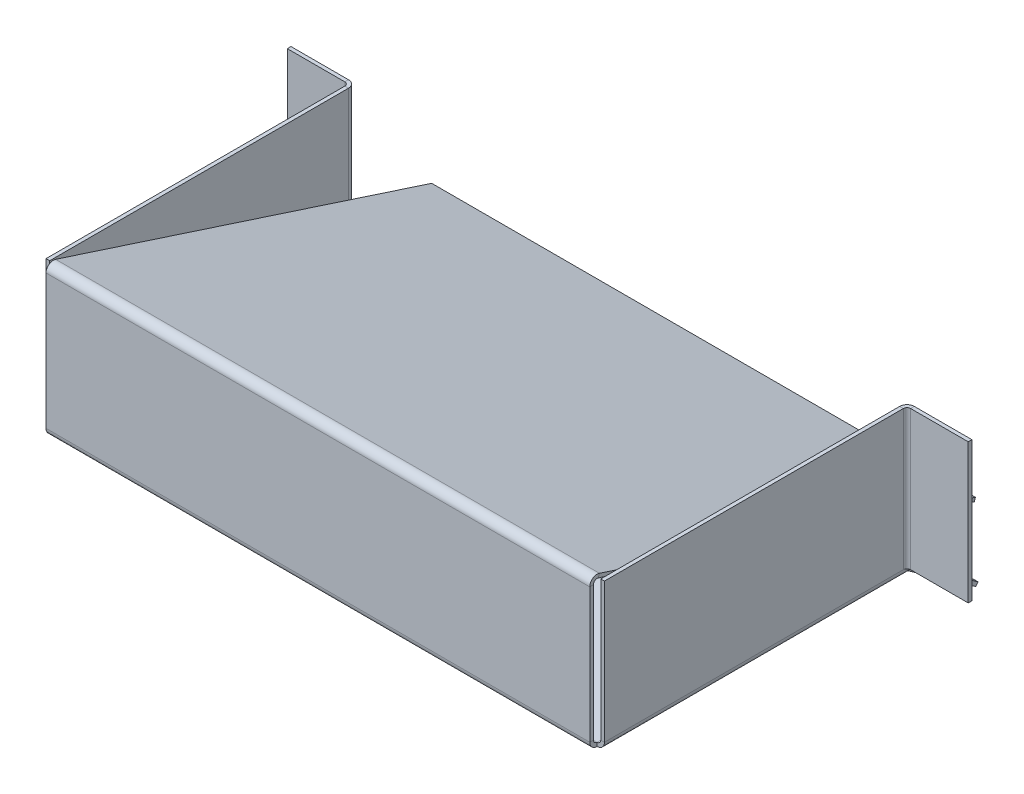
ISO-10303-21;
HEADER;
FILE_DESCRIPTION(('STEP AP214'),'2;1');
FILE_NAME('part.step','',(''),(''),'','','');
FILE_SCHEMA(('AUTOMOTIVE_DESIGN { 1 0 10303 214 1 1 1 1 }'));
ENDSEC;
DATA;
#1=APPLICATION_CONTEXT('core data for automotive mechanical design processes');
#2=APPLICATION_PROTOCOL_DEFINITION('international standard','automotive_design',2000,#1);
#3=PRODUCT_CONTEXT('',#1,'mechanical');
#4=PRODUCT('Part','Part','',(#3));
#5=PRODUCT_RELATED_PRODUCT_CATEGORY('part','',(#4));
#6=PRODUCT_DEFINITION_FORMATION('','',#4);
#7=PRODUCT_DEFINITION_CONTEXT('part definition',#1,'design');
#8=PRODUCT_DEFINITION('design','',#6,#7);
#9=PRODUCT_DEFINITION_SHAPE('','',#8);
#10=(LENGTH_UNIT() NAMED_UNIT(*) SI_UNIT(.MILLI.,.METRE.));
#11=(NAMED_UNIT(*) PLANE_ANGLE_UNIT() SI_UNIT($,.RADIAN.));
#12=(NAMED_UNIT(*) SI_UNIT($,.STERADIAN.) SOLID_ANGLE_UNIT());
#13=UNCERTAINTY_MEASURE_WITH_UNIT(LENGTH_MEASURE(1.E-05),#10,'distance_accuracy_value','');
#14=(GEOMETRIC_REPRESENTATION_CONTEXT(3) GLOBAL_UNCERTAINTY_ASSIGNED_CONTEXT((#13)) GLOBAL_UNIT_ASSIGNED_CONTEXT((#10,
#11,#12)) REPRESENTATION_CONTEXT('',''));
#15=CARTESIAN_POINT('',(0.,0.,0.));
#16=DIRECTION('',(0.,0.,1.));
#17=DIRECTION('',(1.,0.,0.));
#18=AXIS2_PLACEMENT_3D('',#15,#16,#17);
#19=CARTESIAN_POINT('',(1504.55584509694,112.870854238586,250.));
#20=DIRECTION('',(-1.,0.,0.));
#21=DIRECTION('',(0.,0.,1.));
#22=AXIS2_PLACEMENT_3D('',#19,#20,#21);
#23=PLANE('',#22);
#24=DIRECTION('',(0.,0.951056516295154,-0.309016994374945));
#25=VECTOR('',#24,1.);
#26=CARTESIAN_POINT('',(1504.55584509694,115.724023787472,249.072949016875));
#27=LINE('',#26,#25);
#28=CARTESIAN_POINT('',(1504.55584509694,115.724023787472,249.072949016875));
#29=VERTEX_POINT('',#28);
#30=CARTESIAN_POINT('',(1504.55584509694,118.577193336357,248.14589803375));
#31=VERTEX_POINT('',#30);
#32=EDGE_CURVE('E1066',#29,#31,#27,.T.);
#33=ORIENTED_EDGE('',*,*,#32,.F.);
#34=CARTESIAN_POINT('',(1504.55584509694,112.870854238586,250.));
#35=DIRECTION('',(1.,0.,0.));
#36=DIRECTION('',(0.,0.,-1.));
#37=AXIS2_PLACEMENT_3D('',#34,#35,#36);
#38=CIRCLE('',#37,3.);
#39=CARTESIAN_POINT('',(1504.55584509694,112.870854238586,253.));
#40=VERTEX_POINT('',#39);
#41=EDGE_CURVE('E272',#40,#29,#38,.F.);
#42=ORIENTED_EDGE('',*,*,#41,.F.);
#43=DIRECTION('',(0.,0.,1.));
#44=VECTOR('',#43,1.);
#45=CARTESIAN_POINT('',(1504.55584509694,112.870854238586,253.));
#46=LINE('',#45,#44);
#47=CARTESIAN_POINT('',(1504.55584509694,112.870854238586,256.));
#48=VERTEX_POINT('',#47);
#49=EDGE_CURVE('E11',#40,#48,#46,.T.);
#50=ORIENTED_EDGE('',*,*,#49,.T.);
#51=CARTESIAN_POINT('',(1504.55584509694,112.870854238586,250.));
#52=DIRECTION('',(1.,0.,0.));
#53=DIRECTION('',(0.,0.,-1.));
#54=AXIS2_PLACEMENT_3D('',#51,#52,#53);
#55=CIRCLE('',#54,6.);
#56=EDGE_CURVE('E635',#48,#31,#55,.F.);
#57=ORIENTED_EDGE('',*,*,#56,.T.);
#58=EDGE_LOOP('',(#33,#42,#50,#57));
#59=FACE_BOUND('',#58,.T.);
#60=ADVANCED_FACE('F26',(#59),#23,.T.);
#61=CARTESIAN_POINT('',(1948.55584509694,112.870854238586,250.));
#62=DIRECTION('',(-1.,0.,0.));
#63=DIRECTION('',(0.,0.,1.));
#64=AXIS2_PLACEMENT_3D('',#61,#62,#63);
#65=PLANE('',#64);
#66=CARTESIAN_POINT('',(1948.55584509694,112.870854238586,250.));
#67=DIRECTION('',(1.,0.,0.));
#68=DIRECTION('',(0.,0.,-1.));
#69=AXIS2_PLACEMENT_3D('',#66,#67,#68);
#70=CIRCLE('',#69,3.);
#71=CARTESIAN_POINT('',(1948.55584509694,115.724023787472,249.072949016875));
#72=VERTEX_POINT('',#71);
#73=CARTESIAN_POINT('',(1948.55584509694,112.870854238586,253.));
#74=VERTEX_POINT('',#73);
#75=EDGE_CURVE('E278',#72,#74,#70,.T.);
#76=ORIENTED_EDGE('',*,*,#75,.F.);
#77=DIRECTION('',(0.,0.951056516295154,-0.309016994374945));
#78=VECTOR('',#77,1.);
#79=CARTESIAN_POINT('',(1948.55584509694,115.724023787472,249.072949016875));
#80=LINE('',#79,#78);
#81=CARTESIAN_POINT('',(1948.55584509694,118.577193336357,248.14589803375));
#82=VERTEX_POINT('',#81);
#83=EDGE_CURVE('E276',#72,#82,#80,.T.);
#84=ORIENTED_EDGE('',*,*,#83,.T.);
#85=CARTESIAN_POINT('',(1948.55584509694,112.870854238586,250.));
#86=DIRECTION('',(1.,0.,0.));
#87=DIRECTION('',(0.,0.,-1.));
#88=AXIS2_PLACEMENT_3D('',#85,#86,#87);
#89=CIRCLE('',#88,6.);
#90=CARTESIAN_POINT('',(1948.55584509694,112.870854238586,256.));
#91=VERTEX_POINT('',#90);
#92=EDGE_CURVE('E267',#82,#91,#89,.T.);
#93=ORIENTED_EDGE('',*,*,#92,.T.);
#94=DIRECTION('',(0.,0.,1.));
#95=VECTOR('',#94,1.);
#96=CARTESIAN_POINT('',(1948.55584509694,112.870854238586,253.));
#97=LINE('',#96,#95);
#98=EDGE_CURVE('E30',#74,#91,#97,.T.);
#99=ORIENTED_EDGE('',*,*,#98,.F.);
#100=EDGE_LOOP('',(#76,#84,#93,#99));
#101=FACE_BOUND('',#100,.T.);
#102=ADVANCED_FACE('F28',(#101),#65,.F.);
#103=CARTESIAN_POINT('',(1948.55584509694,112.870854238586,250.));
#104=DIRECTION('',(1.,0.,0.));
#105=DIRECTION('',(0.,0.951056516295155,-0.309016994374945));
#106=AXIS2_PLACEMENT_3D('',#103,#104,#105);
#107=CYLINDRICAL_SURFACE('',#106,6.);
#108=DIRECTION('',(1.,0.,0.));
#109=VECTOR('',#108,1.);
#110=CARTESIAN_POINT('',(1948.55584509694,112.870854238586,256.));
#111=LINE('',#110,#109);
#112=EDGE_CURVE('E41',#91,#48,#111,.F.);
#113=ORIENTED_EDGE('',*,*,#112,.F.);
#114=ORIENTED_EDGE('',*,*,#92,.F.);
#115=DIRECTION('',(-1.,0.,0.));
#116=VECTOR('',#115,1.);
#117=CARTESIAN_POINT('',(1504.55584509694,118.577193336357,248.14589803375));
#118=LINE('',#117,#116);
#119=EDGE_CURVE('E46',#82,#31,#118,.T.);
#120=ORIENTED_EDGE('',*,*,#119,.T.);
#121=ORIENTED_EDGE('',*,*,#56,.F.);
#122=EDGE_LOOP('',(#113,#114,#120,#121));
#123=FACE_BOUND('',#122,.T.);
#124=ADVANCED_FACE('F269',(#123),#107,.T.);
#125=CARTESIAN_POINT('',(1948.55584509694,112.870854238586,250.));
#126=DIRECTION('',(1.,0.,0.));
#127=DIRECTION('',(0.,0.951056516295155,-0.309016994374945));
#128=AXIS2_PLACEMENT_3D('',#125,#126,#127);
#129=CYLINDRICAL_SURFACE('',#128,3.);
#130=DIRECTION('',(1.,0.,0.));
#131=VECTOR('',#130,1.);
#132=CARTESIAN_POINT('',(1948.55584509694,112.870854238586,253.));
#133=LINE('',#132,#131);
#134=EDGE_CURVE('E631',#74,#40,#133,.F.);
#135=ORIENTED_EDGE('',*,*,#134,.T.);
#136=ORIENTED_EDGE('',*,*,#41,.T.);
#137=DIRECTION('',(1.,0.,0.));
#138=VECTOR('',#137,1.);
#139=CARTESIAN_POINT('',(1504.55584509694,115.724023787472,249.072949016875));
#140=LINE('',#139,#138);
#141=EDGE_CURVE('E282',#29,#72,#140,.T.);
#142=ORIENTED_EDGE('',*,*,#141,.T.);
#143=ORIENTED_EDGE('',*,*,#75,.T.);
#144=EDGE_LOOP('',(#135,#136,#142,#143));
#145=FACE_BOUND('',#144,.T.);
#146=ADVANCED_FACE('F745',(#145),#129,.F.);
#147=CARTESIAN_POINT('',(1948.55584509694,117.,256.));
#148=DIRECTION('',(-1.,0.,0.));
#149=DIRECTION('',(0.,-1.,0.));
#150=AXIS2_PLACEMENT_3D('',#147,#148,#149);
#151=PLANE('',#150);
#152=ORIENTED_EDGE('',*,*,#98,.T.);
#153=DIRECTION('',(0.,-1.,0.));
#154=VECTOR('',#153,1.);
#155=CARTESIAN_POINT('',(1948.55584509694,-2.61215550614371E-11,256.));
#156=LINE('',#155,#154);
#157=CARTESIAN_POINT('',(1948.55584509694,3.,256.));
#158=VERTEX_POINT('',#157);
#159=EDGE_CURVE('E437',#158,#91,#156,.F.);
#160=ORIENTED_EDGE('',*,*,#159,.F.);
#161=DIRECTION('',(0.,0.,-1.));
#162=VECTOR('',#161,1.);
#163=CARTESIAN_POINT('',(1948.55584509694,3.,253.));
#164=LINE('',#163,#162);
#165=CARTESIAN_POINT('',(1948.55584509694,3.,253.));
#166=VERTEX_POINT('',#165);
#167=EDGE_CURVE('E448',#166,#158,#164,.F.);
#168=ORIENTED_EDGE('',*,*,#167,.F.);
#169=DIRECTION('',(0.,1.,0.));
#170=VECTOR('',#169,1.);
#171=CARTESIAN_POINT('',(1948.55584509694,117.,253.));
#172=LINE('',#171,#170);
#173=EDGE_CURVE('E442',#166,#74,#172,.T.);
#174=ORIENTED_EDGE('',*,*,#173,.T.);
#175=EDGE_LOOP('',(#152,#160,#168,#174));
#176=FACE_BOUND('',#175,.T.);
#177=ADVANCED_FACE('F640',(#176),#151,.F.);
#178=CARTESIAN_POINT('',(1504.55584509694,0.,256.));
#179=DIRECTION('',(1.,0.,0.));
#180=DIRECTION('',(0.,1.,0.));
#181=AXIS2_PLACEMENT_3D('',#178,#179,#180);
#182=PLANE('',#181);
#183=ORIENTED_EDGE('',*,*,#49,.F.);
#184=DIRECTION('',(0.,-1.,0.));
#185=VECTOR('',#184,1.);
#186=CARTESIAN_POINT('',(1504.55584509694,0.,253.));
#187=LINE('',#186,#185);
#188=CARTESIAN_POINT('',(1504.55584509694,3.,253.));
#189=VERTEX_POINT('',#188);
#190=EDGE_CURVE('E440',#40,#189,#187,.T.);
#191=ORIENTED_EDGE('',*,*,#190,.T.);
#192=DIRECTION('',(0.,0.,-1.));
#193=VECTOR('',#192,1.);
#194=CARTESIAN_POINT('',(1504.55584509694,3.,256.));
#195=LINE('',#194,#193);
#196=CARTESIAN_POINT('',(1504.55584509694,3.,256.));
#197=VERTEX_POINT('',#196);
#198=EDGE_CURVE('E433',#189,#197,#195,.F.);
#199=ORIENTED_EDGE('',*,*,#198,.T.);
#200=DIRECTION('',(0.,1.,0.));
#201=VECTOR('',#200,1.);
#202=CARTESIAN_POINT('',(1504.55584509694,0.,256.));
#203=LINE('',#202,#201);
#204=EDGE_CURVE('E434',#48,#197,#203,.F.);
#205=ORIENTED_EDGE('',*,*,#204,.F.);
#206=EDGE_LOOP('',(#183,#191,#199,#205));
#207=FACE_BOUND('',#206,.T.);
#208=ADVANCED_FACE('F656',(#207),#182,.F.);
#209=CARTESIAN_POINT('',(1504.55584509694,0.,256.));
#210=DIRECTION('',(0.,0.,1.));
#211=DIRECTION('',(1.,0.,0.));
#212=AXIS2_PLACEMENT_3D('',#209,#210,#211);
#213=PLANE('',#212);
#214=ORIENTED_EDGE('',*,*,#159,.T.);
#215=ORIENTED_EDGE('',*,*,#112,.T.);
#216=ORIENTED_EDGE('',*,*,#204,.T.);
#217=DIRECTION('',(1.,0.,0.));
#218=VECTOR('',#217,1.);
#219=CARTESIAN_POINT('',(1504.55584509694,3.,256.));
#220=LINE('',#219,#218);
#221=EDGE_CURVE('E445',#197,#158,#220,.T.);
#222=ORIENTED_EDGE('',*,*,#221,.T.);
#223=EDGE_LOOP('',(#214,#215,#216,#222));
#224=FACE_BOUND('',#223,.T.);
#225=ADVANCED_FACE('F644',(#224),#213,.T.);
#226=CARTESIAN_POINT('',(1504.55584509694,0.,253.));
#227=DIRECTION('',(0.,0.,1.));
#228=DIRECTION('',(1.,0.,0.));
#229=AXIS2_PLACEMENT_3D('',#226,#227,#228);
#230=PLANE('',#229);
#231=ORIENTED_EDGE('',*,*,#134,.F.);
#232=ORIENTED_EDGE('',*,*,#173,.F.);
#233=DIRECTION('',(-1.,0.,0.));
#234=VECTOR('',#233,1.);
#235=CARTESIAN_POINT('',(1504.55584509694,3.,253.));
#236=LINE('',#235,#234);
#237=EDGE_CURVE('E451',#189,#166,#236,.F.);
#238=ORIENTED_EDGE('',*,*,#237,.F.);
#239=ORIENTED_EDGE('',*,*,#190,.F.);
#240=EDGE_LOOP('',(#231,#232,#238,#239));
#241=FACE_BOUND('',#240,.T.);
#242=ADVANCED_FACE('F661',(#241),#230,.F.);
#243=CARTESIAN_POINT('',(1948.55584509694,-6.00000000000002,0.945896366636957));
#244=DIRECTION('',(-1.,0.,0.));
#245=DIRECTION('',(0.,0.,1.));
#246=AXIS2_PLACEMENT_3D('',#243,#244,#245);
#247=PLANE('',#246);
#248=CARTESIAN_POINT('',(1948.55584509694,-6.00000000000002,0.945896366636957));
#249=DIRECTION('',(1.,0.,0.));
#250=DIRECTION('',(0.,0.,-1.));
#251=AXIS2_PLACEMENT_3D('',#248,#249,#250);
#252=CIRCLE('',#251,6.00000000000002);
#253=CARTESIAN_POINT('',(1948.55584509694,-1.08508773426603,-2.49556225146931));
#254=VERTEX_POINT('',#253);
#255=CARTESIAN_POINT('',(1948.55584509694,-0.0750291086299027,0.));
#256=VERTEX_POINT('',#255);
#257=EDGE_CURVE('E623',#254,#256,#252,.T.);
#258=ORIENTED_EDGE('',*,*,#257,.T.);
#259=DIRECTION('',(0.,-1.,0.));
#260=VECTOR('',#259,1.);
#261=CARTESIAN_POINT('',(1948.55584509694,0.,0.));
#262=LINE('',#261,#260);
#263=CARTESIAN_POINT('',(1948.55584509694,-3.,0.));
#264=VERTEX_POINT('',#263);
#265=EDGE_CURVE('E541',#256,#264,#262,.T.);
#266=ORIENTED_EDGE('',*,*,#265,.T.);
#267=DIRECTION('',(0.,0.,1.));
#268=VECTOR('',#267,1.);
#269=CARTESIAN_POINT('',(1948.55584509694,-3.,0.));
#270=LINE('',#269,#268);
#271=CARTESIAN_POINT('',(1948.55584509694,-3.,0.945896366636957));
#272=VERTEX_POINT('',#271);
#273=EDGE_CURVE('E344',#264,#272,#270,.T.);
#274=ORIENTED_EDGE('',*,*,#273,.T.);
#275=CARTESIAN_POINT('',(1948.55584509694,-6.00000000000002,0.945896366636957));
#276=DIRECTION('',(1.,0.,0.));
#277=DIRECTION('',(0.,0.,-1.));
#278=AXIS2_PLACEMENT_3D('',#275,#276,#277);
#279=CIRCLE('',#278,3.00000000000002);
#280=CARTESIAN_POINT('',(1948.55584509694,-3.54254386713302,-0.77483294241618));
#281=VERTEX_POINT('',#280);
#282=EDGE_CURVE('E609',#281,#272,#279,.T.);
#283=ORIENTED_EDGE('',*,*,#282,.F.);
#284=DIRECTION('',(0.,0.819152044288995,-0.573576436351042));
#285=VECTOR('',#284,1.);
#286=CARTESIAN_POINT('',(1948.55584509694,-3.54254386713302,-0.774832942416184));
#287=LINE('',#286,#285);
#288=EDGE_CURVE('E314',#281,#254,#287,.T.);
#289=ORIENTED_EDGE('',*,*,#288,.T.);
#290=EDGE_LOOP('',(#258,#266,#274,#283,#289));
#291=FACE_BOUND('',#290,.T.);
#292=ADVANCED_FACE('F754',(#291),#247,.F.);
#293=CARTESIAN_POINT('',(1504.55584509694,-6.00000000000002,0.945896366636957));
#294=DIRECTION('',(-1.,0.,0.));
#295=DIRECTION('',(0.,0.,1.));
#296=AXIS2_PLACEMENT_3D('',#293,#294,#295);
#297=PLANE('',#296);
#298=CARTESIAN_POINT('',(1504.55584509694,-6.00000000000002,0.945896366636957));
#299=DIRECTION('',(1.,0.,0.));
#300=DIRECTION('',(0.,0.,-1.));
#301=AXIS2_PLACEMENT_3D('',#298,#299,#300);
#302=CIRCLE('',#301,3.00000000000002);
#303=CARTESIAN_POINT('',(1504.55584509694,-3.,0.945896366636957));
#304=VERTEX_POINT('',#303);
#305=CARTESIAN_POINT('',(1504.55584509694,-3.54254386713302,-0.77483294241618));
#306=VERTEX_POINT('',#305);
#307=EDGE_CURVE('E610',#304,#306,#302,.F.);
#308=ORIENTED_EDGE('',*,*,#307,.F.);
#309=DIRECTION('',(0.,0.,-1.));
#310=VECTOR('',#309,1.);
#311=CARTESIAN_POINT('',(1504.55584509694,-3.,0.945896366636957));
#312=LINE('',#311,#310);
#313=CARTESIAN_POINT('',(1504.55584509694,-3.,0.));
#314=VERTEX_POINT('',#313);
#315=EDGE_CURVE('E341',#304,#314,#312,.T.);
#316=ORIENTED_EDGE('',*,*,#315,.T.);
#317=DIRECTION('',(0.,1.,0.));
#318=VECTOR('',#317,1.);
#319=CARTESIAN_POINT('',(1504.55584509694,-3.,0.));
#320=LINE('',#319,#318);
#321=CARTESIAN_POINT('',(1504.55584509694,-0.0750291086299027,0.));
#322=VERTEX_POINT('',#321);
#323=EDGE_CURVE('E546',#314,#322,#320,.T.);
#324=ORIENTED_EDGE('',*,*,#323,.T.);
#325=CARTESIAN_POINT('',(1504.55584509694,-6.00000000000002,0.945896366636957));
#326=DIRECTION('',(1.,0.,0.));
#327=DIRECTION('',(0.,0.,-1.));
#328=AXIS2_PLACEMENT_3D('',#325,#326,#327);
#329=CIRCLE('',#328,6.00000000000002);
#330=CARTESIAN_POINT('',(1504.55584509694,-1.08508773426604,-2.49556225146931));
#331=VERTEX_POINT('',#330);
#332=EDGE_CURVE('E622',#322,#331,#329,.F.);
#333=ORIENTED_EDGE('',*,*,#332,.T.);
#334=DIRECTION('',(0.,0.819152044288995,-0.573576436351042));
#335=VECTOR('',#334,1.);
#336=CARTESIAN_POINT('',(1504.55584509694,-3.54254386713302,-0.774832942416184));
#337=LINE('',#336,#335);
#338=EDGE_CURVE('E311',#306,#331,#337,.T.);
#339=ORIENTED_EDGE('',*,*,#338,.F.);
#340=EDGE_LOOP('',(#308,#316,#324,#333,#339));
#341=FACE_BOUND('',#340,.T.);
#342=ADVANCED_FACE('F757',(#341),#297,.T.);
#343=CARTESIAN_POINT('',(1948.55584509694,-6.00000000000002,0.945896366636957));
#344=DIRECTION('',(1.,0.,0.));
#345=DIRECTION('',(0.,0.819152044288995,-0.573576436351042));
#346=AXIS2_PLACEMENT_3D('',#343,#344,#345);
#347=CYLINDRICAL_SURFACE('',#346,6.00000000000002);
#348=DIRECTION('',(1.,0.,0.));
#349=VECTOR('',#348,1.);
#350=CARTESIAN_POINT('',(1948.55584509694,0.,0.945896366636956));
#351=LINE('',#350,#349);
#352=CARTESIAN_POINT('',(1948.55584509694,0.,0.945896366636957));
#353=VERTEX_POINT('',#352);
#354=CARTESIAN_POINT('',(1504.55584509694,0.,0.945896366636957));
#355=VERTEX_POINT('',#354);
#356=EDGE_CURVE('E619',#353,#355,#351,.F.);
#357=ORIENTED_EDGE('',*,*,#356,.F.);
#358=EDGE_CURVE('E613',#256,#353,#252,.T.);
#359=ORIENTED_EDGE('',*,*,#358,.F.);
#360=ORIENTED_EDGE('',*,*,#257,.F.);
#361=DIRECTION('',(1.,0.,0.));
#362=VECTOR('',#361,1.);
#363=CARTESIAN_POINT('',(1948.55584509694,-1.08508773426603,-2.49556225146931));
#364=LINE('',#363,#362);
#365=EDGE_CURVE('E317',#331,#254,#364,.T.);
#366=ORIENTED_EDGE('',*,*,#365,.F.);
#367=ORIENTED_EDGE('',*,*,#332,.F.);
#368=EDGE_CURVE('E624',#355,#322,#329,.F.);
#369=ORIENTED_EDGE('',*,*,#368,.F.);
#370=EDGE_LOOP('',(#357,#359,#360,#366,#367,#369));
#371=FACE_BOUND('',#370,.T.);
#372=ADVANCED_FACE('F761',(#371),#347,.T.);
#373=CARTESIAN_POINT('',(1948.55584509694,-6.00000000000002,0.945896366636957));
#374=DIRECTION('',(1.,0.,0.));
#375=DIRECTION('',(0.,0.819152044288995,-0.573576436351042));
#376=AXIS2_PLACEMENT_3D('',#373,#374,#375);
#377=CYLINDRICAL_SURFACE('',#376,3.00000000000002);
#378=DIRECTION('',(1.,0.,0.));
#379=VECTOR('',#378,1.);
#380=CARTESIAN_POINT('',(1948.55584509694,-3.,0.945896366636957));
#381=LINE('',#380,#379);
#382=EDGE_CURVE('E614',#272,#304,#381,.F.);
#383=ORIENTED_EDGE('',*,*,#382,.T.);
#384=ORIENTED_EDGE('',*,*,#307,.T.);
#385=DIRECTION('',(1.,0.,0.));
#386=VECTOR('',#385,1.);
#387=CARTESIAN_POINT('',(1504.55584509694,-3.54254386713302,-0.774832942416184));
#388=LINE('',#387,#386);
#389=EDGE_CURVE('E312',#306,#281,#388,.T.);
#390=ORIENTED_EDGE('',*,*,#389,.T.);
#391=ORIENTED_EDGE('',*,*,#282,.T.);
#392=EDGE_LOOP('',(#383,#384,#390,#391));
#393=FACE_BOUND('',#392,.T.);
#394=ADVANCED_FACE('F765',(#393),#377,.F.);
#395=CARTESIAN_POINT('',(1501.55584509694,0.,250.));
#396=DIRECTION('',(0.,1.,0.));
#397=DIRECTION('',(0.,0.,1.));
#398=AXIS2_PLACEMENT_3D('',#395,#396,#397);
#399=PLANE('',#398);
#400=DIRECTION('',(0.,0.,-1.));
#401=VECTOR('',#400,1.);
#402=CARTESIAN_POINT('',(1948.55584509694,0.,250.));
#403=LINE('',#402,#401);
#404=CARTESIAN_POINT('',(1948.55584509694,0.,250.));
#405=VERTEX_POINT('',#404);
#406=EDGE_CURVE('E522',#405,#353,#403,.T.);
#407=ORIENTED_EDGE('',*,*,#406,.T.);
#408=ORIENTED_EDGE('',*,*,#356,.T.);
#409=DIRECTION('',(0.,0.,-1.));
#410=VECTOR('',#409,1.);
#411=CARTESIAN_POINT('',(1504.55584509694,0.,250.));
#412=LINE('',#411,#410);
#413=CARTESIAN_POINT('',(1504.55584509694,0.,250.));
#414=VERTEX_POINT('',#413);
#415=EDGE_CURVE('E519',#414,#355,#412,.T.);
#416=ORIENTED_EDGE('',*,*,#415,.F.);
#417=DIRECTION('',(1.,0.,0.));
#418=VECTOR('',#417,1.);
#419=CARTESIAN_POINT('',(1501.55584509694,0.,250.));
#420=LINE('',#419,#418);
#421=EDGE_CURVE('E476',#414,#405,#420,.T.);
#422=ORIENTED_EDGE('',*,*,#421,.T.);
#423=EDGE_LOOP('',(#407,#408,#416,#422));
#424=FACE_BOUND('',#423,.T.);
#425=ADVANCED_FACE('F769',(#424),#399,.T.);
#426=CARTESIAN_POINT('',(1501.55584509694,-3.,250.));
#427=DIRECTION('',(0.,1.,0.));
#428=DIRECTION('',(0.,0.,1.));
#429=AXIS2_PLACEMENT_3D('',#426,#427,#428);
#430=PLANE('',#429);
#431=ORIENTED_EDGE('',*,*,#382,.F.);
#432=DIRECTION('',(0.,0.,-1.));
#433=VECTOR('',#432,1.);
#434=CARTESIAN_POINT('',(1948.55584509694,-3.,250.));
#435=LINE('',#434,#433);
#436=CARTESIAN_POINT('',(1948.55584509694,-3.,250.));
#437=VERTEX_POINT('',#436);
#438=EDGE_CURVE('E502',#437,#272,#435,.T.);
#439=ORIENTED_EDGE('',*,*,#438,.F.);
#440=DIRECTION('',(1.,0.,0.));
#441=VECTOR('',#440,1.);
#442=CARTESIAN_POINT('',(1501.55584509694,-3.,250.));
#443=LINE('',#442,#441);
#444=CARTESIAN_POINT('',(1504.55584509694,-3.,250.));
#445=VERTEX_POINT('',#444);
#446=EDGE_CURVE('E494',#445,#437,#443,.T.);
#447=ORIENTED_EDGE('',*,*,#446,.F.);
#448=DIRECTION('',(0.,0.,-1.));
#449=VECTOR('',#448,1.);
#450=CARTESIAN_POINT('',(1504.55584509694,-3.,250.));
#451=LINE('',#450,#449);
#452=EDGE_CURVE('E505',#445,#304,#451,.T.);
#453=ORIENTED_EDGE('',*,*,#452,.T.);
#454=EDGE_LOOP('',(#431,#439,#447,#453));
#455=FACE_BOUND('',#454,.T.);
#456=ADVANCED_FACE('F677',(#455),#430,.F.);
#457=CARTESIAN_POINT('',(1957.55584509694,3.,5.99999999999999));
#458=DIRECTION('',(0.,-1.,0.));
#459=DIRECTION('',(0.,0.,-1.));
#460=AXIS2_PLACEMENT_3D('',#457,#458,#459);
#461=PLANE('',#460);
#462=CARTESIAN_POINT('',(1957.55584509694,3.,5.99999999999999));
#463=DIRECTION('',(0.,1.,0.));
#464=DIRECTION('',(0.,0.,1.));
#465=AXIS2_PLACEMENT_3D('',#462,#463,#464);
#466=CIRCLE('',#465,3.);
#467=CARTESIAN_POINT('',(1954.55584509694,3.,5.99999999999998));
#468=VERTEX_POINT('',#467);
#469=CARTESIAN_POINT('',(1957.55584509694,3.,2.99999999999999));
#470=VERTEX_POINT('',#469);
#471=EDGE_CURVE('E589',#468,#470,#466,.F.);
#472=ORIENTED_EDGE('',*,*,#471,.F.);
#473=DIRECTION('',(0.,0.,-1.));
#474=VECTOR('',#473,1.);
#475=CARTESIAN_POINT('',(1954.55584509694,3.,5.99999999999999));
#476=LINE('',#475,#474);
#477=CARTESIAN_POINT('',(1954.55584509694,3.,0.803847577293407));
#478=VERTEX_POINT('',#477);
#479=EDGE_CURVE('E388',#468,#478,#476,.T.);
#480=ORIENTED_EDGE('',*,*,#479,.T.);
#481=CARTESIAN_POINT('',(1957.55584509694,3.,5.99999999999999));
#482=DIRECTION('',(0.,1.,0.));
#483=DIRECTION('',(0.,0.,1.));
#484=AXIS2_PLACEMENT_3D('',#481,#482,#483);
#485=CIRCLE('',#484,6.);
#486=CARTESIAN_POINT('',(1957.55584509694,3.,0.));
#487=VERTEX_POINT('',#486);
#488=EDGE_CURVE('E601',#478,#487,#485,.F.);
#489=ORIENTED_EDGE('',*,*,#488,.T.);
#490=DIRECTION('',(0.,0.,-1.));
#491=VECTOR('',#490,1.);
#492=CARTESIAN_POINT('',(1957.55584509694,3.,-1.74773390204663E-13));
#493=LINE('',#492,#491);
#494=EDGE_CURVE('E355',#470,#487,#493,.T.);
#495=ORIENTED_EDGE('',*,*,#494,.F.);
#496=EDGE_LOOP('',(#472,#480,#489,#495));
#497=FACE_BOUND('',#496,.T.);
#498=ADVANCED_FACE('F706',(#497),#461,.T.);
#499=CARTESIAN_POINT('',(1957.55584509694,116.999999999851,5.99999999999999));
#500=DIRECTION('',(0.,-1.,0.));
#501=DIRECTION('',(0.,0.,-1.));
#502=AXIS2_PLACEMENT_3D('',#499,#500,#501);
#503=PLANE('',#502);
#504=CARTESIAN_POINT('',(1957.55584509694,116.999999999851,5.99999999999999));
#505=DIRECTION('',(0.,1.,0.));
#506=DIRECTION('',(0.,0.,1.));
#507=AXIS2_PLACEMENT_3D('',#504,#505,#506);
#508=CIRCLE('',#507,3.);
#509=CARTESIAN_POINT('',(1957.55584509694,116.999999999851,2.99999999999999));
#510=VERTEX_POINT('',#509);
#511=CARTESIAN_POINT('',(1954.55584509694,116.999999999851,5.99999999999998));
#512=VERTEX_POINT('',#511);
#513=EDGE_CURVE('E596',#510,#512,#508,.T.);
#514=ORIENTED_EDGE('',*,*,#513,.F.);
#515=DIRECTION('',(0.,0.,-1.));
#516=VECTOR('',#515,1.);
#517=CARTESIAN_POINT('',(1957.55584509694,116.999999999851,3.));
#518=LINE('',#517,#516);
#519=CARTESIAN_POINT('',(1957.55584509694,116.999999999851,0.));
#520=VERTEX_POINT('',#519);
#521=EDGE_CURVE('E381',#510,#520,#518,.T.);
#522=ORIENTED_EDGE('',*,*,#521,.T.);
#523=CARTESIAN_POINT('',(1957.55584509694,116.999999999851,5.99999999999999));
#524=DIRECTION('',(0.,1.,0.));
#525=DIRECTION('',(0.,0.,1.));
#526=AXIS2_PLACEMENT_3D('',#523,#524,#525);
#527=CIRCLE('',#526,6.);
#528=CARTESIAN_POINT('',(1951.55584509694,116.999999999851,5.99999999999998));
#529=VERTEX_POINT('',#528);
#530=EDGE_CURVE('E592',#520,#529,#527,.T.);
#531=ORIENTED_EDGE('',*,*,#530,.T.);
#532=DIRECTION('',(-1.,0.,0.));
#533=VECTOR('',#532,1.);
#534=CARTESIAN_POINT('',(1954.55584509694,116.999999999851,5.99999999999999));
#535=LINE('',#534,#533);
#536=EDGE_CURVE('E605',#512,#529,#535,.T.);
#537=ORIENTED_EDGE('',*,*,#536,.F.);
#538=EDGE_LOOP('',(#514,#522,#531,#537));
#539=FACE_BOUND('',#538,.T.);
#540=ADVANCED_FACE('F728',(#539),#503,.F.);
#541=CARTESIAN_POINT('',(1957.55584509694,116.999999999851,5.99999999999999));
#542=DIRECTION('',(0.,1.,0.));
#543=DIRECTION('',(0.,0.,-1.));
#544=AXIS2_PLACEMENT_3D('',#541,#542,#543);
#545=CYLINDRICAL_SURFACE('',#544,6.);
#546=DIRECTION('',(0.,1.,0.));
#547=VECTOR('',#546,1.);
#548=CARTESIAN_POINT('',(1951.55584509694,116.999999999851,5.99999999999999));
#549=LINE('',#548,#547);
#550=CARTESIAN_POINT('',(1951.55584509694,3.,5.99999999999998));
#551=VERTEX_POINT('',#550);
#552=EDGE_CURVE('E599',#529,#551,#549,.F.);
#553=ORIENTED_EDGE('',*,*,#552,.F.);
#554=ORIENTED_EDGE('',*,*,#530,.F.);
#555=DIRECTION('',(0.,1.,0.));
#556=VECTOR('',#555,1.);
#557=CARTESIAN_POINT('',(1957.55584509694,116.999999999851,0.));
#558=LINE('',#557,#556);
#559=EDGE_CURVE('E378',#487,#520,#558,.T.);
#560=ORIENTED_EDGE('',*,*,#559,.F.);
#561=ORIENTED_EDGE('',*,*,#488,.F.);
#562=EDGE_CURVE('E602',#551,#478,#485,.F.);
#563=ORIENTED_EDGE('',*,*,#562,.F.);
#564=EDGE_LOOP('',(#553,#554,#560,#561,#563));
#565=FACE_BOUND('',#564,.T.);
#566=ADVANCED_FACE('F702',(#565),#545,.T.);
#567=CARTESIAN_POINT('',(1957.55584509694,116.999999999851,5.99999999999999));
#568=DIRECTION('',(0.,1.,0.));
#569=DIRECTION('',(0.,0.,-1.));
#570=AXIS2_PLACEMENT_3D('',#567,#568,#569);
#571=CYLINDRICAL_SURFACE('',#570,3.);
#572=DIRECTION('',(0.,1.,0.));
#573=VECTOR('',#572,1.);
#574=CARTESIAN_POINT('',(1954.55584509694,116.999999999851,5.99999999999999));
#575=LINE('',#574,#573);
#576=EDGE_CURVE('E593',#512,#468,#575,.F.);
#577=ORIENTED_EDGE('',*,*,#576,.T.);
#578=ORIENTED_EDGE('',*,*,#471,.T.);
#579=DIRECTION('',(0.,-1.,0.));
#580=VECTOR('',#579,1.);
#581=CARTESIAN_POINT('',(1957.55584509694,3.,2.99999999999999));
#582=LINE('',#581,#580);
#583=EDGE_CURVE('E384',#470,#510,#582,.F.);
#584=ORIENTED_EDGE('',*,*,#583,.T.);
#585=ORIENTED_EDGE('',*,*,#513,.T.);
#586=EDGE_LOOP('',(#577,#578,#584,#585));
#587=FACE_BOUND('',#586,.T.);
#588=ADVANCED_FACE('F709',(#587),#571,.F.);
#589=CARTESIAN_POINT('',(1954.55584509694,0.,250.));
#590=DIRECTION('',(-1.,0.,0.));
#591=DIRECTION('',(0.,0.,1.));
#592=AXIS2_PLACEMENT_3D('',#589,#590,#591);
#593=PLANE('',#592);
#594=ORIENTED_EDGE('',*,*,#576,.F.);
#595=DIRECTION('',(0.,0.,-1.));
#596=VECTOR('',#595,1.);
#597=CARTESIAN_POINT('',(1954.55584509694,116.999999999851,250.));
#598=LINE('',#597,#596);
#599=CARTESIAN_POINT('',(1954.55584509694,116.999999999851,250.));
#600=VERTEX_POINT('',#599);
#601=EDGE_CURVE('E531',#600,#512,#598,.T.);
#602=ORIENTED_EDGE('',*,*,#601,.F.);
#603=DIRECTION('',(0.,1.,0.));
#604=VECTOR('',#603,1.);
#605=CARTESIAN_POINT('',(1954.55584509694,0.,250.));
#606=LINE('',#605,#604);
#607=CARTESIAN_POINT('',(1954.55584509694,3.,250.));
#608=VERTEX_POINT('',#607);
#609=EDGE_CURVE('E465',#608,#600,#606,.T.);
#610=ORIENTED_EDGE('',*,*,#609,.F.);
#611=DIRECTION('',(0.,0.,-1.));
#612=VECTOR('',#611,1.);
#613=CARTESIAN_POINT('',(1954.55584509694,3.,250.));
#614=LINE('',#613,#612);
#615=EDGE_CURVE('E499',#608,#468,#614,.T.);
#616=ORIENTED_EDGE('',*,*,#615,.T.);
#617=EDGE_LOOP('',(#594,#602,#610,#616));
#618=FACE_BOUND('',#617,.T.);
#619=ADVANCED_FACE('F683',(#618),#593,.F.);
#620=CARTESIAN_POINT('',(1951.55584509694,116.999999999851,250.));
#621=DIRECTION('',(0.,1.,0.));
#622=DIRECTION('',(0.,0.,1.));
#623=AXIS2_PLACEMENT_3D('',#620,#621,#622);
#624=PLANE('',#623);
#625=ORIENTED_EDGE('',*,*,#601,.T.);
#626=ORIENTED_EDGE('',*,*,#536,.T.);
#627=DIRECTION('',(0.,0.,-1.));
#628=VECTOR('',#627,1.);
#629=CARTESIAN_POINT('',(1951.55584509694,116.999999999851,250.));
#630=LINE('',#629,#628);
#631=CARTESIAN_POINT('',(1951.55584509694,116.999999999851,250.));
#632=VERTEX_POINT('',#631);
#633=EDGE_CURVE('E528',#632,#529,#630,.T.);
#634=ORIENTED_EDGE('',*,*,#633,.F.);
#635=DIRECTION('',(1.,0.,0.));
#636=VECTOR('',#635,1.);
#637=CARTESIAN_POINT('',(1951.55584509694,116.999999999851,250.));
#638=LINE('',#637,#636);
#639=EDGE_CURVE('E467',#632,#600,#638,.T.);
#640=ORIENTED_EDGE('',*,*,#639,.T.);
#641=EDGE_LOOP('',(#625,#626,#634,#640));
#642=FACE_BOUND('',#641,.T.);
#643=ADVANCED_FACE('F823',(#642),#624,.T.);
#644=CARTESIAN_POINT('',(1951.55584509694,0.,250.));
#645=DIRECTION('',(-1.,0.,0.));
#646=DIRECTION('',(0.,0.,1.));
#647=AXIS2_PLACEMENT_3D('',#644,#645,#646);
#648=PLANE('',#647);
#649=ORIENTED_EDGE('',*,*,#633,.T.);
#650=ORIENTED_EDGE('',*,*,#552,.T.);
#651=DIRECTION('',(0.,0.,-1.));
#652=VECTOR('',#651,1.);
#653=CARTESIAN_POINT('',(1951.55584509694,3.,250.));
#654=LINE('',#653,#652);
#655=CARTESIAN_POINT('',(1951.55584509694,3.,250.));
#656=VERTEX_POINT('',#655);
#657=EDGE_CURVE('E525',#656,#551,#654,.T.);
#658=ORIENTED_EDGE('',*,*,#657,.F.);
#659=DIRECTION('',(0.,1.,0.));
#660=VECTOR('',#659,1.);
#661=CARTESIAN_POINT('',(1951.55584509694,0.,250.));
#662=LINE('',#661,#660);
#663=EDGE_CURVE('E470',#656,#632,#662,.T.);
#664=ORIENTED_EDGE('',*,*,#663,.T.);
#665=EDGE_LOOP('',(#649,#650,#658,#664));
#666=FACE_BOUND('',#665,.T.);
#667=ADVANCED_FACE('F690',(#666),#648,.T.);
#668=CARTESIAN_POINT('',(1495.55584509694,3.00000000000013,5.99999999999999));
#669=DIRECTION('',(0.,1.,0.));
#670=DIRECTION('',(0.,0.,1.));
#671=AXIS2_PLACEMENT_3D('',#668,#669,#670);
#672=PLANE('',#671);
#673=CARTESIAN_POINT('',(1495.55584509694,3.00000000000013,5.99999999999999));
#674=DIRECTION('',(0.,-1.,0.));
#675=DIRECTION('',(0.,0.,-1.));
#676=AXIS2_PLACEMENT_3D('',#673,#674,#675);
#677=CIRCLE('',#676,6.);
#678=CARTESIAN_POINT('',(1495.55584509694,3.00000000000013,0.));
#679=VERTEX_POINT('',#678);
#680=CARTESIAN_POINT('',(1498.55584509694,3.00000000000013,0.803847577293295));
#681=VERTEX_POINT('',#680);
#682=EDGE_CURVE('E581',#679,#681,#677,.T.);
#683=ORIENTED_EDGE('',*,*,#682,.T.);
#684=DIRECTION('',(0.,0.,1.));
#685=VECTOR('',#684,1.);
#686=CARTESIAN_POINT('',(1498.55584509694,3.00000000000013,0.));
#687=LINE('',#686,#685);
#688=CARTESIAN_POINT('',(1498.55584509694,3.00000000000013,5.99999999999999));
#689=VERTEX_POINT('',#688);
#690=EDGE_CURVE('E430',#681,#689,#687,.T.);
#691=ORIENTED_EDGE('',*,*,#690,.T.);
#692=CARTESIAN_POINT('',(1495.55584509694,3.00000000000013,5.99999999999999));
#693=DIRECTION('',(0.,-1.,0.));
#694=DIRECTION('',(0.,0.,-1.));
#695=AXIS2_PLACEMENT_3D('',#692,#693,#694);
#696=CIRCLE('',#695,3.);
#697=CARTESIAN_POINT('',(1495.55584509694,3.00000000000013,2.99999999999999));
#698=VERTEX_POINT('',#697);
#699=EDGE_CURVE('E566',#698,#689,#696,.T.);
#700=ORIENTED_EDGE('',*,*,#699,.F.);
#701=DIRECTION('',(0.,0.,-1.));
#702=VECTOR('',#701,1.);
#703=CARTESIAN_POINT('',(1495.55584509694,3.00000000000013,3.));
#704=LINE('',#703,#702);
#705=EDGE_CURVE('E420',#698,#679,#704,.T.);
#706=ORIENTED_EDGE('',*,*,#705,.T.);
#707=EDGE_LOOP('',(#683,#691,#700,#706));
#708=FACE_BOUND('',#707,.T.);
#709=ADVANCED_FACE('F779',(#708),#672,.F.);
#710=CARTESIAN_POINT('',(1495.55584509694,117.0000000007,5.99999999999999));
#711=DIRECTION('',(0.,1.,0.));
#712=DIRECTION('',(0.,0.,1.));
#713=AXIS2_PLACEMENT_3D('',#710,#711,#712);
#714=PLANE('',#713);
#715=DIRECTION('',(0.,0.,-1.));
#716=VECTOR('',#715,1.);
#717=CARTESIAN_POINT('',(1495.55584509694,117.0000000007,-1.74773390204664E-13));
#718=LINE('',#717,#716);
#719=CARTESIAN_POINT('',(1495.55584509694,117.0000000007,2.99999999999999));
#720=VERTEX_POINT('',#719);
#721=CARTESIAN_POINT('',(1495.55584509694,117.0000000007,0.));
#722=VERTEX_POINT('',#721);
#723=EDGE_CURVE('E394',#720,#722,#718,.T.);
#724=ORIENTED_EDGE('',*,*,#723,.F.);
#725=CARTESIAN_POINT('',(1495.55584509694,117.0000000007,5.99999999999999));
#726=DIRECTION('',(0.,-1.,0.));
#727=DIRECTION('',(0.,0.,-1.));
#728=AXIS2_PLACEMENT_3D('',#725,#726,#727);
#729=CIRCLE('',#728,3.);
#730=CARTESIAN_POINT('',(1498.55584509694,117.0000000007,5.99999999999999));
#731=VERTEX_POINT('',#730);
#732=EDGE_CURVE('E569',#731,#720,#729,.F.);
#733=ORIENTED_EDGE('',*,*,#732,.F.);
#734=DIRECTION('',(1.,0.,0.));
#735=VECTOR('',#734,1.);
#736=CARTESIAN_POINT('',(1498.55584509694,117.0000000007,5.99999999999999));
#737=LINE('',#736,#735);
#738=CARTESIAN_POINT('',(1501.55584509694,117.0000000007,5.99999999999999));
#739=VERTEX_POINT('',#738);
#740=EDGE_CURVE('E584',#731,#739,#737,.T.);
#741=ORIENTED_EDGE('',*,*,#740,.T.);
#742=CARTESIAN_POINT('',(1495.55584509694,117.0000000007,5.99999999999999));
#743=DIRECTION('',(0.,-1.,0.));
#744=DIRECTION('',(0.,0.,-1.));
#745=AXIS2_PLACEMENT_3D('',#742,#743,#744);
#746=CIRCLE('',#745,6.);
#747=EDGE_CURVE('E580',#739,#722,#746,.F.);
#748=ORIENTED_EDGE('',*,*,#747,.T.);
#749=EDGE_LOOP('',(#724,#733,#741,#748));
#750=FACE_BOUND('',#749,.T.);
#751=ADVANCED_FACE('F782',(#750),#714,.T.);
#752=CARTESIAN_POINT('',(1495.55584509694,3.00000000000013,5.99999999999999));
#753=DIRECTION('',(0.,-1.,0.));
#754=DIRECTION('',(0.,0.,-1.));
#755=AXIS2_PLACEMENT_3D('',#752,#753,#754);
#756=CYLINDRICAL_SURFACE('',#755,6.);
#757=DIRECTION('',(0.,-1.,0.));
#758=VECTOR('',#757,1.);
#759=CARTESIAN_POINT('',(1501.55584509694,3.00000000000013,5.99999999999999));
#760=LINE('',#759,#758);
#761=CARTESIAN_POINT('',(1501.55584509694,3.00000000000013,5.99999999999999));
#762=VERTEX_POINT('',#761);
#763=EDGE_CURVE('E578',#762,#739,#760,.F.);
#764=ORIENTED_EDGE('',*,*,#763,.F.);
#765=EDGE_CURVE('E572',#681,#762,#677,.T.);
#766=ORIENTED_EDGE('',*,*,#765,.F.);
#767=ORIENTED_EDGE('',*,*,#682,.F.);
#768=DIRECTION('',(0.,-1.,0.));
#769=VECTOR('',#768,1.);
#770=CARTESIAN_POINT('',(1495.55584509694,3.00000000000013,0.));
#771=LINE('',#770,#769);
#772=EDGE_CURVE('E417',#722,#679,#771,.T.);
#773=ORIENTED_EDGE('',*,*,#772,.F.);
#774=ORIENTED_EDGE('',*,*,#747,.F.);
#775=EDGE_LOOP('',(#764,#766,#767,#773,#774));
#776=FACE_BOUND('',#775,.T.);
#777=ADVANCED_FACE('F786',(#776),#756,.T.);
#778=CARTESIAN_POINT('',(1495.55584509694,3.00000000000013,5.99999999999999));
#779=DIRECTION('',(0.,-1.,0.));
#780=DIRECTION('',(0.,0.,-1.));
#781=AXIS2_PLACEMENT_3D('',#778,#779,#780);
#782=CYLINDRICAL_SURFACE('',#781,3.);
#783=DIRECTION('',(0.,-1.,0.));
#784=VECTOR('',#783,1.);
#785=CARTESIAN_POINT('',(1498.55584509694,3.00000000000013,5.99999999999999));
#786=LINE('',#785,#784);
#787=EDGE_CURVE('E573',#689,#731,#786,.F.);
#788=ORIENTED_EDGE('',*,*,#787,.T.);
#789=ORIENTED_EDGE('',*,*,#732,.T.);
#790=DIRECTION('',(0.,1.,0.));
#791=VECTOR('',#790,1.);
#792=CARTESIAN_POINT('',(1495.55584509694,117.0000000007,2.99999999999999));
#793=LINE('',#792,#791);
#794=EDGE_CURVE('E423',#720,#698,#793,.F.);
#795=ORIENTED_EDGE('',*,*,#794,.T.);
#796=ORIENTED_EDGE('',*,*,#699,.T.);
#797=EDGE_LOOP('',(#788,#789,#795,#796));
#798=FACE_BOUND('',#797,.T.);
#799=ADVANCED_FACE('F790',(#798),#782,.F.);
#800=CARTESIAN_POINT('',(1501.55584509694,117.0000000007,250.));
#801=DIRECTION('',(1.,0.,0.));
#802=DIRECTION('',(0.,0.,-1.));
#803=AXIS2_PLACEMENT_3D('',#800,#801,#802);
#804=PLANE('',#803);
#805=DIRECTION('',(0.,0.,-1.));
#806=VECTOR('',#805,1.);
#807=CARTESIAN_POINT('',(1501.55584509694,3.00000000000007,250.));
#808=LINE('',#807,#806);
#809=CARTESIAN_POINT('',(1501.55584509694,3.00000000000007,250.));
#810=VERTEX_POINT('',#809);
#811=EDGE_CURVE('E516',#810,#762,#808,.T.);
#812=ORIENTED_EDGE('',*,*,#811,.T.);
#813=ORIENTED_EDGE('',*,*,#763,.T.);
#814=DIRECTION('',(0.,0.,-1.));
#815=VECTOR('',#814,1.);
#816=CARTESIAN_POINT('',(1501.55584509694,117.0000000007,250.));
#817=LINE('',#816,#815);
#818=CARTESIAN_POINT('',(1501.55584509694,117.0000000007,250.));
#819=VERTEX_POINT('',#818);
#820=EDGE_CURVE('E513',#819,#739,#817,.T.);
#821=ORIENTED_EDGE('',*,*,#820,.F.);
#822=DIRECTION('',(0.,-1.,0.));
#823=VECTOR('',#822,1.);
#824=CARTESIAN_POINT('',(1501.55584509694,117.0000000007,250.));
#825=LINE('',#824,#823);
#826=EDGE_CURVE('E482',#819,#810,#825,.T.);
#827=ORIENTED_EDGE('',*,*,#826,.T.);
#828=EDGE_LOOP('',(#812,#813,#821,#827));
#829=FACE_BOUND('',#828,.T.);
#830=ADVANCED_FACE('F794',(#829),#804,.T.);
#831=CARTESIAN_POINT('',(1498.55584509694,117.0000000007,250.));
#832=DIRECTION('',(1.,0.,0.));
#833=DIRECTION('',(0.,0.,-1.));
#834=AXIS2_PLACEMENT_3D('',#831,#832,#833);
#835=PLANE('',#834);
#836=ORIENTED_EDGE('',*,*,#787,.F.);
#837=DIRECTION('',(0.,0.,-1.));
#838=VECTOR('',#837,1.);
#839=CARTESIAN_POINT('',(1498.55584509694,3.00000000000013,250.));
#840=LINE('',#839,#838);
#841=CARTESIAN_POINT('',(1498.55584509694,3.00000000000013,250.));
#842=VERTEX_POINT('',#841);
#843=EDGE_CURVE('E508',#842,#689,#840,.T.);
#844=ORIENTED_EDGE('',*,*,#843,.F.);
#845=DIRECTION('',(0.,1.,0.));
#846=VECTOR('',#845,1.);
#847=CARTESIAN_POINT('',(1498.55584509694,117.0000000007,250.));
#848=LINE('',#847,#846);
#849=CARTESIAN_POINT('',(1498.55584509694,117.0000000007,250.));
#850=VERTEX_POINT('',#849);
#851=EDGE_CURVE('E488',#850,#842,#848,.F.);
#852=ORIENTED_EDGE('',*,*,#851,.F.);
#853=DIRECTION('',(0.,0.,-1.));
#854=VECTOR('',#853,1.);
#855=CARTESIAN_POINT('',(1498.55584509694,117.0000000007,250.));
#856=LINE('',#855,#854);
#857=EDGE_CURVE('E510',#850,#731,#856,.T.);
#858=ORIENTED_EDGE('',*,*,#857,.T.);
#859=EDGE_LOOP('',(#836,#844,#852,#858));
#860=FACE_BOUND('',#859,.T.);
#861=ADVANCED_FACE('F800',(#860),#835,.F.);
#862=CARTESIAN_POINT('',(1504.55584509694,3.,250.));
#863=DIRECTION('',(-1.,0.,0.));
#864=DIRECTION('',(0.,0.,1.));
#865=AXIS2_PLACEMENT_3D('',#862,#863,#864);
#866=PLANE('',#865);
#867=ORIENTED_EDGE('',*,*,#198,.F.);
#868=CARTESIAN_POINT('',(1504.55584509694,3.,250.));
#869=DIRECTION('',(1.,0.,0.));
#870=DIRECTION('',(0.,0.,-1.));
#871=AXIS2_PLACEMENT_3D('',#868,#869,#870);
#872=CIRCLE('',#871,3.);
#873=EDGE_CURVE('E557',#414,#189,#872,.F.);
#874=ORIENTED_EDGE('',*,*,#873,.F.);
#875=DIRECTION('',(0.,-1.,0.));
#876=VECTOR('',#875,1.);
#877=CARTESIAN_POINT('',(1504.55584509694,0.,250.));
#878=LINE('',#877,#876);
#879=EDGE_CURVE('E553',#414,#445,#878,.T.);
#880=ORIENTED_EDGE('',*,*,#879,.T.);
#881=CARTESIAN_POINT('',(1504.55584509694,3.,250.));
#882=DIRECTION('',(1.,0.,0.));
#883=DIRECTION('',(0.,0.,-1.));
#884=AXIS2_PLACEMENT_3D('',#881,#882,#883);
#885=CIRCLE('',#884,6.);
#886=EDGE_CURVE('E563',#445,#197,#885,.F.);
#887=ORIENTED_EDGE('',*,*,#886,.T.);
#888=EDGE_LOOP('',(#867,#874,#880,#887));
#889=FACE_BOUND('',#888,.T.);
#890=ADVANCED_FACE('F651',(#889),#866,.T.);
#891=CARTESIAN_POINT('',(1948.55584509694,3.,250.));
#892=DIRECTION('',(-1.,0.,0.));
#893=DIRECTION('',(0.,0.,1.));
#894=AXIS2_PLACEMENT_3D('',#891,#892,#893);
#895=PLANE('',#894);
#896=CARTESIAN_POINT('',(1948.55584509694,3.,250.));
#897=DIRECTION('',(1.,0.,0.));
#898=DIRECTION('',(0.,0.,-1.));
#899=AXIS2_PLACEMENT_3D('',#896,#897,#898);
#900=CIRCLE('',#899,3.);
#901=EDGE_CURVE('E556',#166,#405,#900,.T.);
#902=ORIENTED_EDGE('',*,*,#901,.F.);
#903=ORIENTED_EDGE('',*,*,#167,.T.);
#904=CARTESIAN_POINT('',(1948.55584509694,3.,250.));
#905=DIRECTION('',(1.,0.,0.));
#906=DIRECTION('',(0.,0.,-1.));
#907=AXIS2_PLACEMENT_3D('',#904,#905,#906);
#908=CIRCLE('',#907,6.);
#909=EDGE_CURVE('E560',#158,#437,#908,.T.);
#910=ORIENTED_EDGE('',*,*,#909,.T.);
#911=DIRECTION('',(0.,1.,0.));
#912=VECTOR('',#911,1.);
#913=CARTESIAN_POINT('',(1948.55584509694,-3.,250.));
#914=LINE('',#913,#912);
#915=EDGE_CURVE('E540',#437,#405,#914,.T.);
#916=ORIENTED_EDGE('',*,*,#915,.T.);
#917=EDGE_LOOP('',(#902,#903,#910,#916));
#918=FACE_BOUND('',#917,.T.);
#919=ADVANCED_FACE('F667',(#918),#895,.F.);
#920=CARTESIAN_POINT('',(1948.55584509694,3.,250.));
#921=DIRECTION('',(1.,0.,0.));
#922=DIRECTION('',(0.,0.,1.));
#923=AXIS2_PLACEMENT_3D('',#920,#921,#922);
#924=CYLINDRICAL_SURFACE('',#923,6.);
#925=ORIENTED_EDGE('',*,*,#446,.T.);
#926=ORIENTED_EDGE('',*,*,#909,.F.);
#927=ORIENTED_EDGE('',*,*,#221,.F.);
#928=ORIENTED_EDGE('',*,*,#886,.F.);
#929=EDGE_LOOP('',(#925,#926,#927,#928));
#930=FACE_BOUND('',#929,.T.);
#931=ADVANCED_FACE('F648',(#930),#924,.T.);
#932=CARTESIAN_POINT('',(1948.55584509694,3.,250.));
#933=DIRECTION('',(1.,0.,0.));
#934=DIRECTION('',(0.,0.,1.));
#935=AXIS2_PLACEMENT_3D('',#932,#933,#934);
#936=CYLINDRICAL_SURFACE('',#935,3.);
#937=ORIENTED_EDGE('',*,*,#421,.F.);
#938=ORIENTED_EDGE('',*,*,#873,.T.);
#939=ORIENTED_EDGE('',*,*,#237,.T.);
#940=ORIENTED_EDGE('',*,*,#901,.T.);
#941=EDGE_LOOP('',(#937,#938,#939,#940));
#942=FACE_BOUND('',#941,.T.);
#943=ADVANCED_FACE('F664',(#942),#936,.F.);
#944=CARTESIAN_POINT('',(1504.55584509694,0.,250.));
#945=DIRECTION('',(0.,0.,1.));
#946=DIRECTION('',(1.,0.,0.));
#947=AXIS2_PLACEMENT_3D('',#944,#945,#946);
#948=PLANE('',#947);
#949=ORIENTED_EDGE('',*,*,#879,.F.);
#950=CARTESIAN_POINT('',(1504.55584509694,3.00000000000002,250.));
#951=DIRECTION('',(0.,0.,-1.));
#952=DIRECTION('',(-1.,0.,0.));
#953=AXIS2_PLACEMENT_3D('',#950,#951,#952);
#954=CIRCLE('',#953,3.);
#955=EDGE_CURVE('E479',#810,#414,#954,.F.);
#956=ORIENTED_EDGE('',*,*,#955,.F.);
#957=DIRECTION('',(1.,0.,0.));
#958=VECTOR('',#957,1.);
#959=CARTESIAN_POINT('',(1498.55584509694,3.00000000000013,250.));
#960=LINE('',#959,#958);
#961=EDGE_CURVE('E551',#842,#810,#960,.T.);
#962=ORIENTED_EDGE('',*,*,#961,.F.);
#963=CARTESIAN_POINT('',(1504.55584509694,3.00000000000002,250.));
#964=DIRECTION('',(0.,0.,1.));
#965=DIRECTION('',(1.,0.,0.));
#966=AXIS2_PLACEMENT_3D('',#963,#964,#965);
#967=CIRCLE('',#966,6.);
#968=EDGE_CURVE('E491',#842,#445,#967,.T.);
#969=ORIENTED_EDGE('',*,*,#968,.T.);
#970=EDGE_LOOP('',(#949,#956,#962,#969));
#971=FACE_BOUND('',#970,.T.);
#972=ADVANCED_FACE('F805',(#971),#948,.T.);
#973=CARTESIAN_POINT('',(1501.55584509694,3.00000000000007,0.));
#974=DIRECTION('',(0.,0.,-1.));
#975=DIRECTION('',(-1.,0.,0.));
#976=AXIS2_PLACEMENT_3D('',#973,#974,#975);
#977=PLANE('',#976);
#978=DIRECTION('',(-1.,0.,0.));
#979=VECTOR('',#978,1.);
#980=CARTESIAN_POINT('',(1501.55584509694,3.00000000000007,0.));
#981=LINE('',#980,#979);
#982=CARTESIAN_POINT('',(1501.55584509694,3.00000000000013,0.));
#983=VERTEX_POINT('',#982);
#984=CARTESIAN_POINT('',(1498.55584509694,3.00000000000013,0.));
#985=VERTEX_POINT('',#984);
#986=EDGE_CURVE('E549',#983,#985,#981,.T.);
#987=ORIENTED_EDGE('',*,*,#986,.F.);
#988=CARTESIAN_POINT('',(1504.55584509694,3.00000000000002,0.));
#989=DIRECTION('',(0.,0.,-1.));
#990=DIRECTION('',(-1.,0.,0.));
#991=AXIS2_PLACEMENT_3D('',#988,#989,#990);
#992=CIRCLE('',#991,3.);
#993=CARTESIAN_POINT('',(1504.55584509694,0.,0.));
#994=VERTEX_POINT('',#993);
#995=EDGE_CURVE('E456',#983,#994,#992,.F.);
#996=ORIENTED_EDGE('',*,*,#995,.T.);
#997=EDGE_CURVE('E545',#322,#994,#320,.T.);
#998=ORIENTED_EDGE('',*,*,#997,.F.);
#999=ORIENTED_EDGE('',*,*,#323,.F.);
#1000=CARTESIAN_POINT('',(1504.55584509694,3.00000000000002,0.));
#1001=DIRECTION('',(0.,0.,1.));
#1002=DIRECTION('',(1.,0.,0.));
#1003=AXIS2_PLACEMENT_3D('',#1000,#1001,#1002);
#1004=CIRCLE('',#1003,6.);
#1005=EDGE_CURVE('E459',#985,#314,#1004,.T.);
#1006=ORIENTED_EDGE('',*,*,#1005,.F.);
#1007=EDGE_LOOP('',(#987,#996,#998,#999,#1006));
#1008=FACE_BOUND('',#1007,.T.);
#1009=ADVANCED_FACE('F808',(#1008),#977,.T.);
#1010=CARTESIAN_POINT('',(1951.55584509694,3.,250.));
#1011=DIRECTION('',(0.,0.,1.));
#1012=DIRECTION('',(1.,0.,0.));
#1013=AXIS2_PLACEMENT_3D('',#1010,#1011,#1012);
#1014=PLANE('',#1013);
#1015=DIRECTION('',(1.,0.,0.));
#1016=VECTOR('',#1015,1.);
#1017=CARTESIAN_POINT('',(1951.55584509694,3.,250.));
#1018=LINE('',#1017,#1016);
#1019=EDGE_CURVE('E543',#656,#608,#1018,.T.);
#1020=ORIENTED_EDGE('',*,*,#1019,.F.);
#1021=CARTESIAN_POINT('',(1948.55584509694,3.,250.));
#1022=DIRECTION('',(0.,0.,-1.));
#1023=DIRECTION('',(-1.,0.,0.));
#1024=AXIS2_PLACEMENT_3D('',#1021,#1022,#1023);
#1025=CIRCLE('',#1024,3.);
#1026=EDGE_CURVE('E473',#405,#656,#1025,.F.);
#1027=ORIENTED_EDGE('',*,*,#1026,.F.);
#1028=ORIENTED_EDGE('',*,*,#915,.F.);
#1029=CARTESIAN_POINT('',(1948.55584509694,3.,250.));
#1030=DIRECTION('',(0.,0.,1.));
#1031=DIRECTION('',(1.,0.,0.));
#1032=AXIS2_PLACEMENT_3D('',#1029,#1030,#1031);
#1033=CIRCLE('',#1032,6.);
#1034=EDGE_CURVE('E496',#437,#608,#1033,.T.);
#1035=ORIENTED_EDGE('',*,*,#1034,.T.);
#1036=EDGE_LOOP('',(#1020,#1027,#1028,#1035));
#1037=FACE_BOUND('',#1036,.T.);
#1038=ADVANCED_FACE('F672',(#1037),#1014,.T.);
#1039=CARTESIAN_POINT('',(1948.55584509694,-3.,250.));
#1040=DIRECTION('',(0.,0.,1.));
#1041=DIRECTION('',(1.,0.,0.));
#1042=AXIS2_PLACEMENT_3D('',#1039,#1040,#1041);
#1043=PLANE('',#1042);
#1044=ORIENTED_EDGE('',*,*,#663,.F.);
#1045=ORIENTED_EDGE('',*,*,#1019,.T.);
#1046=ORIENTED_EDGE('',*,*,#609,.T.);
#1047=ORIENTED_EDGE('',*,*,#639,.F.);
#1048=EDGE_LOOP('',(#1044,#1045,#1046,#1047));
#1049=FACE_BOUND('',#1048,.T.);
#1050=ADVANCED_FACE('F687',(#1049),#1043,.T.);
#1051=CARTESIAN_POINT('',(1948.55584509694,0.,0.));
#1052=DIRECTION('',(0.,0.,-1.));
#1053=DIRECTION('',(-1.,0.,0.));
#1054=AXIS2_PLACEMENT_3D('',#1051,#1052,#1053);
#1055=PLANE('',#1054);
#1056=CARTESIAN_POINT('',(1948.55584509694,0.,0.));
#1057=VERTEX_POINT('',#1056);
#1058=EDGE_CURVE('E537',#1057,#256,#262,.T.);
#1059=ORIENTED_EDGE('',*,*,#1058,.F.);
#1060=CARTESIAN_POINT('',(1948.55584509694,3.,0.));
#1061=DIRECTION('',(0.,0.,-1.));
#1062=DIRECTION('',(-1.,0.,0.));
#1063=AXIS2_PLACEMENT_3D('',#1060,#1061,#1062);
#1064=CIRCLE('',#1063,3.);
#1065=CARTESIAN_POINT('',(1951.55584509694,3.,0.));
#1066=VERTEX_POINT('',#1065);
#1067=EDGE_CURVE('E436',#1057,#1066,#1064,.F.);
#1068=ORIENTED_EDGE('',*,*,#1067,.T.);
#1069=DIRECTION('',(-1.,0.,0.));
#1070=VECTOR('',#1069,1.);
#1071=CARTESIAN_POINT('',(1954.55584509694,3.,0.));
#1072=LINE('',#1071,#1070);
#1073=CARTESIAN_POINT('',(1954.55584509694,3.,0.));
#1074=VERTEX_POINT('',#1073);
#1075=EDGE_CURVE('E534',#1074,#1066,#1072,.T.);
#1076=ORIENTED_EDGE('',*,*,#1075,.F.);
#1077=CARTESIAN_POINT('',(1948.55584509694,3.,0.));
#1078=DIRECTION('',(0.,0.,1.));
#1079=DIRECTION('',(1.,0.,0.));
#1080=AXIS2_PLACEMENT_3D('',#1077,#1078,#1079);
#1081=CIRCLE('',#1080,6.);
#1082=EDGE_CURVE('E462',#264,#1074,#1081,.T.);
#1083=ORIENTED_EDGE('',*,*,#1082,.F.);
#1084=ORIENTED_EDGE('',*,*,#265,.F.);
#1085=EDGE_LOOP('',(#1059,#1068,#1076,#1083,#1084));
#1086=FACE_BOUND('',#1085,.T.);
#1087=ADVANCED_FACE('F817',(#1086),#1055,.T.);
#1088=CARTESIAN_POINT('',(1948.55584509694,3.,250.));
#1089=DIRECTION('',(0.,0.,-1.));
#1090=DIRECTION('',(-1.,0.,0.));
#1091=AXIS2_PLACEMENT_3D('',#1088,#1089,#1090);
#1092=CYLINDRICAL_SURFACE('',#1091,3.);
#1093=ORIENTED_EDGE('',*,*,#1067,.F.);
#1094=DIRECTION('',(0.,0.,1.));
#1095=VECTOR('',#1094,1.);
#1096=CARTESIAN_POINT('',(1948.55584509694,0.,250.));
#1097=LINE('',#1096,#1095);
#1098=EDGE_CURVE('E347',#1057,#353,#1097,.T.);
#1099=ORIENTED_EDGE('',*,*,#1098,.T.);
#1100=ORIENTED_EDGE('',*,*,#406,.F.);
#1101=ORIENTED_EDGE('',*,*,#1026,.T.);
#1102=ORIENTED_EDGE('',*,*,#657,.T.);
#1103=DIRECTION('',(0.,0.,-1.));
#1104=VECTOR('',#1103,1.);
#1105=CARTESIAN_POINT('',(1951.55584509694,3.00000000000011,250.));
#1106=LINE('',#1105,#1104);
#1107=EDGE_CURVE('E391',#551,#1066,#1106,.T.);
#1108=ORIENTED_EDGE('',*,*,#1107,.T.);
#1109=EDGE_LOOP('',(#1093,#1099,#1100,#1101,#1102,#1108));
#1110=FACE_BOUND('',#1109,.T.);
#1111=ADVANCED_FACE('F695',(#1110),#1092,.F.);
#1112=CARTESIAN_POINT('',(1504.55584509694,3.00000000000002,250.));
#1113=DIRECTION('',(0.,0.,-1.));
#1114=DIRECTION('',(-1.,0.,0.));
#1115=AXIS2_PLACEMENT_3D('',#1112,#1113,#1114);
#1116=CYLINDRICAL_SURFACE('',#1115,3.);
#1117=ORIENTED_EDGE('',*,*,#995,.F.);
#1118=DIRECTION('',(0.,0.,1.));
#1119=VECTOR('',#1118,1.);
#1120=CARTESIAN_POINT('',(1501.55584509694,3.00000000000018,250.));
#1121=LINE('',#1120,#1119);
#1122=EDGE_CURVE('E429',#983,#762,#1121,.T.);
#1123=ORIENTED_EDGE('',*,*,#1122,.T.);
#1124=ORIENTED_EDGE('',*,*,#811,.F.);
#1125=ORIENTED_EDGE('',*,*,#955,.T.);
#1126=ORIENTED_EDGE('',*,*,#415,.T.);
#1127=DIRECTION('',(0.,0.,-1.));
#1128=VECTOR('',#1127,1.);
#1129=CARTESIAN_POINT('',(1504.55584509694,0.,250.));
#1130=LINE('',#1129,#1128);
#1131=EDGE_CURVE('E352',#355,#994,#1130,.T.);
#1132=ORIENTED_EDGE('',*,*,#1131,.T.);
#1133=EDGE_LOOP('',(#1117,#1123,#1124,#1125,#1126,#1132));
#1134=FACE_BOUND('',#1133,.T.);
#1135=ADVANCED_FACE('F831',(#1134),#1116,.F.);
#1136=CARTESIAN_POINT('',(1498.55584509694,117.0000000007,250.));
#1137=DIRECTION('',(0.,1.,0.));
#1138=DIRECTION('',(0.,0.,1.));
#1139=AXIS2_PLACEMENT_3D('',#1136,#1137,#1138);
#1140=PLANE('',#1139);
#1141=ORIENTED_EDGE('',*,*,#740,.F.);
#1142=ORIENTED_EDGE('',*,*,#857,.F.);
#1143=DIRECTION('',(1.,0.,0.));
#1144=VECTOR('',#1143,1.);
#1145=CARTESIAN_POINT('',(1498.55584509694,117.0000000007,250.));
#1146=LINE('',#1145,#1144);
#1147=EDGE_CURVE('E485',#850,#819,#1146,.T.);
#1148=ORIENTED_EDGE('',*,*,#1147,.T.);
#1149=ORIENTED_EDGE('',*,*,#820,.T.);
#1150=EDGE_LOOP('',(#1141,#1142,#1148,#1149));
#1151=FACE_BOUND('',#1150,.T.);
#1152=ADVANCED_FACE('F837',(#1151),#1140,.T.);
#1153=CARTESIAN_POINT('',(1504.55584509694,3.00000000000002,250.));
#1154=DIRECTION('',(0.,0.,-1.));
#1155=DIRECTION('',(-1.,0.,0.));
#1156=AXIS2_PLACEMENT_3D('',#1153,#1154,#1155);
#1157=CYLINDRICAL_SURFACE('',#1156,6.);
#1158=ORIENTED_EDGE('',*,*,#1005,.T.);
#1159=ORIENTED_EDGE('',*,*,#315,.F.);
#1160=ORIENTED_EDGE('',*,*,#452,.F.);
#1161=ORIENTED_EDGE('',*,*,#968,.F.);
#1162=ORIENTED_EDGE('',*,*,#843,.T.);
#1163=ORIENTED_EDGE('',*,*,#690,.F.);
#1164=EDGE_CURVE('E397',#985,#681,#687,.T.);
#1165=ORIENTED_EDGE('',*,*,#1164,.F.);
#1166=EDGE_LOOP('',(#1158,#1159,#1160,#1161,#1162,#1163,#1165));
#1167=FACE_BOUND('',#1166,.T.);
#1168=ADVANCED_FACE('F844',(#1167),#1157,.T.);
#1169=CARTESIAN_POINT('',(1948.55584509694,3.,250.));
#1170=DIRECTION('',(0.,0.,-1.));
#1171=DIRECTION('',(-1.,0.,0.));
#1172=AXIS2_PLACEMENT_3D('',#1169,#1170,#1171);
#1173=CYLINDRICAL_SURFACE('',#1172,6.);
#1174=ORIENTED_EDGE('',*,*,#1082,.T.);
#1175=EDGE_CURVE('E358',#478,#1074,#476,.T.);
#1176=ORIENTED_EDGE('',*,*,#1175,.F.);
#1177=ORIENTED_EDGE('',*,*,#479,.F.);
#1178=ORIENTED_EDGE('',*,*,#615,.F.);
#1179=ORIENTED_EDGE('',*,*,#1034,.F.);
#1180=ORIENTED_EDGE('',*,*,#438,.T.);
#1181=ORIENTED_EDGE('',*,*,#273,.F.);
#1182=EDGE_LOOP('',(#1174,#1176,#1177,#1178,#1179,#1180,#1181));
#1183=FACE_BOUND('',#1182,.T.);
#1184=ADVANCED_FACE('F679',(#1183),#1173,.T.);
#1185=CARTESIAN_POINT('',(1948.55584509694,3.,250.));
#1186=DIRECTION('',(0.,0.,-1.));
#1187=DIRECTION('',(-1.,0.,0.));
#1188=AXIS2_PLACEMENT_3D('',#1185,#1186,#1187);
#1189=PLANE('',#1188);
#1190=ORIENTED_EDGE('',*,*,#851,.T.);
#1191=ORIENTED_EDGE('',*,*,#961,.T.);
#1192=ORIENTED_EDGE('',*,*,#826,.F.);
#1193=ORIENTED_EDGE('',*,*,#1147,.F.);
#1194=EDGE_LOOP('',(#1190,#1191,#1192,#1193));
#1195=FACE_BOUND('',#1194,.T.);
#1196=ADVANCED_FACE('F856',(#1195),#1189,.F.);
#1197=CARTESIAN_POINT('',(1498.55584509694,3.00000000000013,0.));
#1198=DIRECTION('',(0.,1.,0.));
#1199=DIRECTION('',(0.,0.,1.));
#1200=AXIS2_PLACEMENT_3D('',#1197,#1198,#1199);
#1201=PLANE('',#1200);
#1202=ORIENTED_EDGE('',*,*,#1164,.T.);
#1203=ORIENTED_EDGE('',*,*,#765,.T.);
#1204=ORIENTED_EDGE('',*,*,#1122,.F.);
#1205=ORIENTED_EDGE('',*,*,#986,.T.);
#1206=EDGE_LOOP('',(#1202,#1203,#1204,#1205));
#1207=FACE_BOUND('',#1206,.T.);
#1208=ADVANCED_FACE('F859',(#1207),#1201,.T.);
#1209=CARTESIAN_POINT('',(1498.55584509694,3.00000000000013,0.));
#1210=DIRECTION('',(0.,-1.,0.));
#1211=DIRECTION('',(1.,0.,0.));
#1212=AXIS2_PLACEMENT_3D('',#1209,#1210,#1211);
#1213=PLANE('',#1212);
#1214=DIRECTION('',(1.,0.,0.));
#1215=VECTOR('',#1214,1.);
#1216=CARTESIAN_POINT('',(1498.55584509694,3.00000000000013,0.));
#1217=LINE('',#1216,#1215);
#1218=CARTESIAN_POINT('',(1448.55584509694,3.00000000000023,-1.74574168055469E-13));
#1219=VERTEX_POINT('',#1218);
#1220=EDGE_CURVE('E401',#1219,#679,#1217,.T.);
#1221=ORIENTED_EDGE('',*,*,#1220,.T.);
#1222=ORIENTED_EDGE('',*,*,#705,.F.);
#1223=DIRECTION('',(-1.,0.,0.));
#1224=VECTOR('',#1223,1.);
#1225=CARTESIAN_POINT('',(1498.55584509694,3.00000000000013,3.));
#1226=LINE('',#1225,#1224);
#1227=CARTESIAN_POINT('',(1448.55584509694,3.00000000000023,2.99999999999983));
#1228=VERTEX_POINT('',#1227);
#1229=EDGE_CURVE('E409',#1228,#698,#1226,.F.);
#1230=ORIENTED_EDGE('',*,*,#1229,.F.);
#1231=DIRECTION('',(0.,0.,1.));
#1232=VECTOR('',#1231,1.);
#1233=CARTESIAN_POINT('',(1448.55584509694,3.00000000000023,-1.74773390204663E-13));
#1234=LINE('',#1233,#1232);
#1235=EDGE_CURVE('E395',#1219,#1228,#1234,.T.);
#1236=ORIENTED_EDGE('',*,*,#1235,.F.);
#1237=EDGE_LOOP('',(#1221,#1222,#1230,#1236));
#1238=FACE_BOUND('',#1237,.T.);
#1239=ADVANCED_FACE('F871',(#1238),#1213,.T.);
#1240=CARTESIAN_POINT('',(1448.55584509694,117.0000000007,-1.74773390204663E-13));
#1241=DIRECTION('',(0.,1.,0.));
#1242=DIRECTION('',(-1.,0.,0.));
#1243=AXIS2_PLACEMENT_3D('',#1240,#1241,#1242);
#1244=PLANE('',#1243);
#1245=DIRECTION('',(1.,0.,0.));
#1246=VECTOR('',#1245,1.);
#1247=CARTESIAN_POINT('',(1498.55584509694,117.0000000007,3.));
#1248=LINE('',#1247,#1246);
#1249=CARTESIAN_POINT('',(1448.55584509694,117.0000000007,2.99999999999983));
#1250=VERTEX_POINT('',#1249);
#1251=EDGE_CURVE('E415',#720,#1250,#1248,.F.);
#1252=ORIENTED_EDGE('',*,*,#1251,.F.);
#1253=ORIENTED_EDGE('',*,*,#723,.T.);
#1254=DIRECTION('',(-1.,0.,0.));
#1255=VECTOR('',#1254,1.);
#1256=CARTESIAN_POINT('',(1448.55584509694,117.0000000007,-1.74574168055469E-13));
#1257=LINE('',#1256,#1255);
#1258=CARTESIAN_POINT('',(1448.55584509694,117.0000000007,-1.74574168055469E-13));
#1259=VERTEX_POINT('',#1258);
#1260=EDGE_CURVE('E407',#722,#1259,#1257,.T.);
#1261=ORIENTED_EDGE('',*,*,#1260,.T.);
#1262=DIRECTION('',(0.,0.,1.));
#1263=VECTOR('',#1262,1.);
#1264=CARTESIAN_POINT('',(1448.55584509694,117.0000000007,-1.74773390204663E-13));
#1265=LINE('',#1264,#1263);
#1266=EDGE_CURVE('E398',#1259,#1250,#1265,.T.);
#1267=ORIENTED_EDGE('',*,*,#1266,.T.);
#1268=EDGE_LOOP('',(#1252,#1253,#1261,#1267));
#1269=FACE_BOUND('',#1268,.T.);
#1270=ADVANCED_FACE('F873',(#1269),#1244,.T.);
#1271=CARTESIAN_POINT('',(1498.55584509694,3.00000000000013,0.));
#1272=DIRECTION('',(0.,0.,-1.));
#1273=DIRECTION('',(-1.,0.,0.));
#1274=AXIS2_PLACEMENT_3D('',#1271,#1272,#1273);
#1275=PLANE('',#1274);
#1276=ORIENTED_EDGE('',*,*,#1260,.F.);
#1277=ORIENTED_EDGE('',*,*,#772,.T.);
#1278=ORIENTED_EDGE('',*,*,#1220,.F.);
#1279=DIRECTION('',(0.,-1.,0.));
#1280=VECTOR('',#1279,1.);
#1281=CARTESIAN_POINT('',(1448.55584509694,3.00000000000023,-1.74574168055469E-13));
#1282=LINE('',#1281,#1280);
#1283=EDGE_CURVE('E404',#1259,#1219,#1282,.T.);
#1284=ORIENTED_EDGE('',*,*,#1283,.F.);
#1285=EDGE_LOOP('',(#1276,#1277,#1278,#1284));
#1286=FACE_BOUND('',#1285,.T.);
#1287=ADVANCED_FACE('F876',(#1286),#1275,.T.);
#1288=CARTESIAN_POINT('',(1498.55584509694,3.00000000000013,3.));
#1289=DIRECTION('',(0.,0.,-1.));
#1290=DIRECTION('',(-1.,0.,0.));
#1291=AXIS2_PLACEMENT_3D('',#1288,#1289,#1290);
#1292=PLANE('',#1291);
#1293=ORIENTED_EDGE('',*,*,#794,.F.);
#1294=ORIENTED_EDGE('',*,*,#1251,.T.);
#1295=DIRECTION('',(0.,1.,0.));
#1296=VECTOR('',#1295,1.);
#1297=CARTESIAN_POINT('',(1448.55584509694,3.00000000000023,2.99999999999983));
#1298=LINE('',#1297,#1296);
#1299=EDGE_CURVE('E412',#1250,#1228,#1298,.F.);
#1300=ORIENTED_EDGE('',*,*,#1299,.T.);
#1301=ORIENTED_EDGE('',*,*,#1229,.T.);
#1302=EDGE_LOOP('',(#1293,#1294,#1300,#1301));
#1303=FACE_BOUND('',#1302,.T.);
#1304=ADVANCED_FACE('F881',(#1303),#1292,.F.);
#1305=CARTESIAN_POINT('',(1448.55584509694,3.00000000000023,-1.74773390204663E-13));
#1306=DIRECTION('',(-1.,0.,0.));
#1307=DIRECTION('',(0.,0.,1.));
#1308=AXIS2_PLACEMENT_3D('',#1305,#1306,#1307);
#1309=PLANE('',#1308);
#1310=ORIENTED_EDGE('',*,*,#1299,.F.);
#1311=ORIENTED_EDGE('',*,*,#1266,.F.);
#1312=ORIENTED_EDGE('',*,*,#1283,.T.);
#1313=ORIENTED_EDGE('',*,*,#1235,.T.);
#1314=EDGE_LOOP('',(#1310,#1311,#1312,#1313));
#1315=FACE_BOUND('',#1314,.T.);
#1316=ADVANCED_FACE('F878',(#1315),#1309,.T.);
#1317=CARTESIAN_POINT('',(1954.55584509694,3.,5.99999999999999));
#1318=DIRECTION('',(0.,1.,0.));
#1319=DIRECTION('',(0.,0.,1.));
#1320=AXIS2_PLACEMENT_3D('',#1317,#1318,#1319);
#1321=PLANE('',#1320);
#1322=ORIENTED_EDGE('',*,*,#1107,.F.);
#1323=ORIENTED_EDGE('',*,*,#562,.T.);
#1324=ORIENTED_EDGE('',*,*,#1175,.T.);
#1325=ORIENTED_EDGE('',*,*,#1075,.T.);
#1326=EDGE_LOOP('',(#1322,#1323,#1324,#1325));
#1327=FACE_BOUND('',#1326,.T.);
#1328=ADVANCED_FACE('F698',(#1327),#1321,.T.);
#1329=CARTESIAN_POINT('',(1954.55584509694,116.999999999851,0.));
#1330=DIRECTION('',(0.,1.,0.));
#1331=DIRECTION('',(0.,0.,1.));
#1332=AXIS2_PLACEMENT_3D('',#1329,#1330,#1331);
#1333=PLANE('',#1332);
#1334=DIRECTION('',(-1.,0.,0.));
#1335=VECTOR('',#1334,1.);
#1336=CARTESIAN_POINT('',(1954.55584509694,116.999999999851,0.));
#1337=LINE('',#1336,#1335);
#1338=CARTESIAN_POINT('',(2004.55584509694,116.999999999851,-1.74574168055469E-13));
#1339=VERTEX_POINT('',#1338);
#1340=EDGE_CURVE('E362',#1339,#520,#1337,.T.);
#1341=ORIENTED_EDGE('',*,*,#1340,.T.);
#1342=ORIENTED_EDGE('',*,*,#521,.F.);
#1343=DIRECTION('',(1.,0.,0.));
#1344=VECTOR('',#1343,1.);
#1345=CARTESIAN_POINT('',(1954.55584509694,116.999999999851,3.));
#1346=LINE('',#1345,#1344);
#1347=CARTESIAN_POINT('',(2004.55584509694,116.999999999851,2.99999999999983));
#1348=VERTEX_POINT('',#1347);
#1349=EDGE_CURVE('E370',#1348,#510,#1346,.F.);
#1350=ORIENTED_EDGE('',*,*,#1349,.F.);
#1351=DIRECTION('',(0.,0.,1.));
#1352=VECTOR('',#1351,1.);
#1353=CARTESIAN_POINT('',(2004.55584509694,116.999999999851,-1.74773390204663E-13));
#1354=LINE('',#1353,#1352);
#1355=EDGE_CURVE('E356',#1339,#1348,#1354,.T.);
#1356=ORIENTED_EDGE('',*,*,#1355,.F.);
#1357=EDGE_LOOP('',(#1341,#1342,#1350,#1356));
#1358=FACE_BOUND('',#1357,.T.);
#1359=ADVANCED_FACE('F725',(#1358),#1333,.T.);
#1360=CARTESIAN_POINT('',(2004.55584509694,3.,-1.74773390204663E-13));
#1361=DIRECTION('',(0.,-1.,0.));
#1362=DIRECTION('',(0.,0.,-1.));
#1363=AXIS2_PLACEMENT_3D('',#1360,#1361,#1362);
#1364=PLANE('',#1363);
#1365=DIRECTION('',(-1.,0.,0.));
#1366=VECTOR('',#1365,1.);
#1367=CARTESIAN_POINT('',(1954.55584509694,3.,3.));
#1368=LINE('',#1367,#1366);
#1369=CARTESIAN_POINT('',(2004.55584509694,3.,2.99999999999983));
#1370=VERTEX_POINT('',#1369);
#1371=EDGE_CURVE('E376',#470,#1370,#1368,.F.);
#1372=ORIENTED_EDGE('',*,*,#1371,.F.);
#1373=ORIENTED_EDGE('',*,*,#494,.T.);
#1374=DIRECTION('',(1.,0.,0.));
#1375=VECTOR('',#1374,1.);
#1376=CARTESIAN_POINT('',(2004.55584509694,3.,-1.74574168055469E-13));
#1377=LINE('',#1376,#1375);
#1378=CARTESIAN_POINT('',(2004.55584509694,3.,-1.74574168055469E-13));
#1379=VERTEX_POINT('',#1378);
#1380=EDGE_CURVE('E368',#487,#1379,#1377,.T.);
#1381=ORIENTED_EDGE('',*,*,#1380,.T.);
#1382=DIRECTION('',(0.,0.,1.));
#1383=VECTOR('',#1382,1.);
#1384=CARTESIAN_POINT('',(2004.55584509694,3.,-1.74773390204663E-13));
#1385=LINE('',#1384,#1383);
#1386=EDGE_CURVE('E359',#1379,#1370,#1385,.T.);
#1387=ORIENTED_EDGE('',*,*,#1386,.T.);
#1388=EDGE_LOOP('',(#1372,#1373,#1381,#1387));
#1389=FACE_BOUND('',#1388,.T.);
#1390=ADVANCED_FACE('F717',(#1389),#1364,.T.);
#1391=CARTESIAN_POINT('',(1954.55584509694,116.999999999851,0.));
#1392=DIRECTION('',(0.,0.,-1.));
#1393=DIRECTION('',(-1.,0.,0.));
#1394=AXIS2_PLACEMENT_3D('',#1391,#1392,#1393);
#1395=PLANE('',#1394);
#1396=ORIENTED_EDGE('',*,*,#1380,.F.);
#1397=ORIENTED_EDGE('',*,*,#559,.T.);
#1398=ORIENTED_EDGE('',*,*,#1340,.F.);
#1399=DIRECTION('',(0.,1.,0.));
#1400=VECTOR('',#1399,1.);
#1401=CARTESIAN_POINT('',(2004.55584509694,116.999999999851,-1.74574168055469E-13));
#1402=LINE('',#1401,#1400);
#1403=EDGE_CURVE('E365',#1379,#1339,#1402,.T.);
#1404=ORIENTED_EDGE('',*,*,#1403,.F.);
#1405=EDGE_LOOP('',(#1396,#1397,#1398,#1404));
#1406=FACE_BOUND('',#1405,.T.);
#1407=ADVANCED_FACE('F731',(#1406),#1395,.T.);
#1408=CARTESIAN_POINT('',(1954.55584509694,116.999999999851,3.));
#1409=DIRECTION('',(0.,0.,-1.));
#1410=DIRECTION('',(-1.,0.,0.));
#1411=AXIS2_PLACEMENT_3D('',#1408,#1409,#1410);
#1412=PLANE('',#1411);
#1413=ORIENTED_EDGE('',*,*,#583,.F.);
#1414=ORIENTED_EDGE('',*,*,#1371,.T.);
#1415=DIRECTION('',(0.,-1.,0.));
#1416=VECTOR('',#1415,1.);
#1417=CARTESIAN_POINT('',(2004.55584509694,116.999999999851,2.99999999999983));
#1418=LINE('',#1417,#1416);
#1419=EDGE_CURVE('E373',#1370,#1348,#1418,.F.);
#1420=ORIENTED_EDGE('',*,*,#1419,.T.);
#1421=ORIENTED_EDGE('',*,*,#1349,.T.);
#1422=EDGE_LOOP('',(#1413,#1414,#1420,#1421));
#1423=FACE_BOUND('',#1422,.T.);
#1424=ADVANCED_FACE('F713',(#1423),#1412,.F.);
#1425=CARTESIAN_POINT('',(2004.55584509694,116.999999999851,-1.74773390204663E-13));
#1426=DIRECTION('',(1.,0.,0.));
#1427=DIRECTION('',(0.,0.,-1.));
#1428=AXIS2_PLACEMENT_3D('',#1425,#1426,#1427);
#1429=PLANE('',#1428);
#1430=ORIENTED_EDGE('',*,*,#1419,.F.);
#1431=ORIENTED_EDGE('',*,*,#1386,.F.);
#1432=ORIENTED_EDGE('',*,*,#1403,.T.);
#1433=ORIENTED_EDGE('',*,*,#1355,.T.);
#1434=EDGE_LOOP('',(#1430,#1431,#1432,#1433));
#1435=FACE_BOUND('',#1434,.T.);
#1436=ADVANCED_FACE('F723',(#1435),#1429,.T.);
#1437=CARTESIAN_POINT('',(1948.55584509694,-3.,0.));
#1438=DIRECTION('',(-1.,0.,0.));
#1439=DIRECTION('',(0.,0.,1.));
#1440=AXIS2_PLACEMENT_3D('',#1437,#1438,#1439);
#1441=PLANE('',#1440);
#1442=ORIENTED_EDGE('',*,*,#1058,.T.);
#1443=ORIENTED_EDGE('',*,*,#358,.T.);
#1444=ORIENTED_EDGE('',*,*,#1098,.F.);
#1445=EDGE_LOOP('',(#1442,#1443,#1444));
#1446=FACE_BOUND('',#1445,.T.);
#1447=ADVANCED_FACE('F895',(#1446),#1441,.T.);
#1448=CARTESIAN_POINT('',(1504.55584509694,-3.,0.945896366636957));
#1449=DIRECTION('',(1.,0.,0.));
#1450=DIRECTION('',(0.,0.,-1.));
#1451=AXIS2_PLACEMENT_3D('',#1448,#1449,#1450);
#1452=PLANE('',#1451);
#1453=ORIENTED_EDGE('',*,*,#1131,.F.);
#1454=ORIENTED_EDGE('',*,*,#368,.T.);
#1455=ORIENTED_EDGE('',*,*,#997,.T.);
#1456=EDGE_LOOP('',(#1453,#1454,#1455));
#1457=FACE_BOUND('',#1456,.T.);
#1458=ADVANCED_FACE('F896',(#1457),#1452,.T.);
#1459=CARTESIAN_POINT('',(1948.55584509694,-0.542543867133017,-1.72072930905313));
#1460=DIRECTION('',(1.,0.,0.));
#1461=DIRECTION('',(0.,0.,-1.));
#1462=AXIS2_PLACEMENT_3D('',#1459,#1460,#1461);
#1463=PLANE('',#1462);
#1464=DIRECTION('',(0.,0.573576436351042,0.819152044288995));
#1465=VECTOR('',#1464,1.);
#1466=CARTESIAN_POINT('',(1948.55584509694,-0.542543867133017,-1.72072930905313));
#1467=LINE('',#1466,#1465);
#1468=CARTESIAN_POINT('',(1948.55584509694,-42.0499018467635,-60.9993798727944));
#1469=VERTEX_POINT('',#1468);
#1470=EDGE_CURVE('E335',#1469,#254,#1467,.T.);
#1471=ORIENTED_EDGE('',*,*,#1470,.T.);
#1472=ORIENTED_EDGE('',*,*,#288,.F.);
#1473=DIRECTION('',(0.,0.573576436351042,0.819152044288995));
#1474=VECTOR('',#1473,1.);
#1475=CARTESIAN_POINT('',(1948.55584509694,-3.,0.));
#1476=LINE('',#1475,#1474);
#1477=CARTESIAN_POINT('',(1948.55584509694,-44.5073579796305,-59.2786505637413));
#1478=VERTEX_POINT('',#1477);
#1479=EDGE_CURVE('E327',#1478,#281,#1476,.T.);
#1480=ORIENTED_EDGE('',*,*,#1479,.F.);
#1481=DIRECTION('',(0.,-0.819152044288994,0.573576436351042));
#1482=VECTOR('',#1481,1.);
#1483=CARTESIAN_POINT('',(1948.55584509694,-42.0499018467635,-60.9993798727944));
#1484=LINE('',#1483,#1482);
#1485=EDGE_CURVE('E339',#1469,#1478,#1484,.T.);
#1486=ORIENTED_EDGE('',*,*,#1485,.F.);
#1487=EDGE_LOOP('',(#1471,#1472,#1480,#1486));
#1488=FACE_BOUND('',#1487,.T.);
#1489=ADVANCED_FACE('F935',(#1488),#1463,.T.);
#1490=CARTESIAN_POINT('',(1504.55584509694,-42.0499018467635,-60.9993798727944));
#1491=DIRECTION('',(-1.,0.,0.));
#1492=DIRECTION('',(0.,0.,1.));
#1493=AXIS2_PLACEMENT_3D('',#1490,#1491,#1492);
#1494=PLANE('',#1493);
#1495=DIRECTION('',(0.,-0.573576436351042,-0.819152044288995));
#1496=VECTOR('',#1495,1.);
#1497=CARTESIAN_POINT('',(1504.55584509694,-44.5073579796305,-59.2786505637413));
#1498=LINE('',#1497,#1496);
#1499=CARTESIAN_POINT('',(1504.55584509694,-44.5073579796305,-59.2786505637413));
#1500=VERTEX_POINT('',#1499);
#1501=EDGE_CURVE('E322',#306,#1500,#1498,.T.);
#1502=ORIENTED_EDGE('',*,*,#1501,.F.);
#1503=ORIENTED_EDGE('',*,*,#338,.T.);
#1504=DIRECTION('',(0.,-0.573576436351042,-0.819152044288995));
#1505=VECTOR('',#1504,1.);
#1506=CARTESIAN_POINT('',(1504.55584509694,-42.0499018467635,-60.9993798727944));
#1507=LINE('',#1506,#1505);
#1508=CARTESIAN_POINT('',(1504.55584509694,-42.0499018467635,-60.9993798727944));
#1509=VERTEX_POINT('',#1508);
#1510=EDGE_CURVE('E330',#331,#1509,#1507,.T.);
#1511=ORIENTED_EDGE('',*,*,#1510,.T.);
#1512=DIRECTION('',(0.,-0.819152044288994,0.573576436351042));
#1513=VECTOR('',#1512,1.);
#1514=CARTESIAN_POINT('',(1504.55584509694,-42.0499018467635,-60.9993798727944));
#1515=LINE('',#1514,#1513);
#1516=EDGE_CURVE('E338',#1509,#1500,#1515,.T.);
#1517=ORIENTED_EDGE('',*,*,#1516,.T.);
#1518=EDGE_LOOP('',(#1502,#1503,#1511,#1517));
#1519=FACE_BOUND('',#1518,.T.);
#1520=ADVANCED_FACE('F952',(#1519),#1494,.T.);
#1521=CARTESIAN_POINT('',(1948.55584509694,-0.542543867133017,-1.72072930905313));
#1522=DIRECTION('',(0.,0.819152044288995,-0.573576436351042));
#1523=DIRECTION('',(0.,0.573576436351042,0.819152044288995));
#1524=AXIS2_PLACEMENT_3D('',#1521,#1522,#1523);
#1525=PLANE('',#1524);
#1526=ORIENTED_EDGE('',*,*,#1510,.F.);
#1527=ORIENTED_EDGE('',*,*,#365,.T.);
#1528=ORIENTED_EDGE('',*,*,#1470,.F.);
#1529=DIRECTION('',(1.,0.,0.));
#1530=VECTOR('',#1529,1.);
#1531=CARTESIAN_POINT('',(1948.55584509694,-42.0499018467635,-60.9993798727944));
#1532=LINE('',#1531,#1530);
#1533=EDGE_CURVE('E332',#1509,#1469,#1532,.T.);
#1534=ORIENTED_EDGE('',*,*,#1533,.F.);
#1535=EDGE_LOOP('',(#1526,#1527,#1528,#1534));
#1536=FACE_BOUND('',#1535,.T.);
#1537=ADVANCED_FACE('F962',(#1536),#1525,.T.);
#1538=CARTESIAN_POINT('',(1948.55584509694,-3.,0.));
#1539=DIRECTION('',(0.,0.819152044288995,-0.573576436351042));
#1540=DIRECTION('',(0.,0.573576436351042,0.819152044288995));
#1541=AXIS2_PLACEMENT_3D('',#1538,#1539,#1540);
#1542=PLANE('',#1541);
#1543=ORIENTED_EDGE('',*,*,#389,.F.);
#1544=ORIENTED_EDGE('',*,*,#1501,.T.);
#1545=DIRECTION('',(1.,0.,0.));
#1546=VECTOR('',#1545,1.);
#1547=CARTESIAN_POINT('',(1948.55584509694,-44.5073579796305,-59.2786505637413));
#1548=LINE('',#1547,#1546);
#1549=EDGE_CURVE('E324',#1500,#1478,#1548,.T.);
#1550=ORIENTED_EDGE('',*,*,#1549,.T.);
#1551=ORIENTED_EDGE('',*,*,#1479,.T.);
#1552=EDGE_LOOP('',(#1543,#1544,#1550,#1551));
#1553=FACE_BOUND('',#1552,.T.);
#1554=ADVANCED_FACE('F972',(#1553),#1542,.F.);
#1555=CARTESIAN_POINT('',(1948.55584509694,-42.0499018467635,-60.9993798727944));
#1556=DIRECTION('',(0.,-0.573576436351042,-0.819152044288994));
#1557=DIRECTION('',(0.,0.819152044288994,-0.573576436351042));
#1558=AXIS2_PLACEMENT_3D('',#1555,#1556,#1557);
#1559=PLANE('',#1558);
#1560=ORIENTED_EDGE('',*,*,#1549,.F.);
#1561=ORIENTED_EDGE('',*,*,#1516,.F.);
#1562=ORIENTED_EDGE('',*,*,#1533,.T.);
#1563=ORIENTED_EDGE('',*,*,#1485,.T.);
#1564=EDGE_LOOP('',(#1560,#1561,#1562,#1563));
#1565=FACE_BOUND('',#1564,.T.);
#1566=ADVANCED_FACE('F982',(#1565),#1559,.T.);
#1567=CARTESIAN_POINT('',(1948.55584509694,18.8046123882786,-58.9225318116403));
#1568=DIRECTION('',(-1.,0.,0.));
#1569=DIRECTION('',(0.,0.,1.));
#1570=AXIS2_PLACEMENT_3D('',#1567,#1568,#1569);
#1571=PLANE('',#1570);
#1572=ORIENTED_EDGE('',*,*,#83,.F.);
#1573=DIRECTION('',(0.,-0.309016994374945,-0.951056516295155));
#1574=VECTOR('',#1573,1.);
#1575=CARTESIAN_POINT('',(1948.55584509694,15.9514428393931,-57.9954808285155));
#1576=LINE('',#1575,#1574);
#1577=CARTESIAN_POINT('',(1948.55584509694,15.9514428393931,-57.9954808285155));
#1578=VERTEX_POINT('',#1577);
#1579=EDGE_CURVE('E291',#72,#1578,#1576,.T.);
#1580=ORIENTED_EDGE('',*,*,#1579,.T.);
#1581=DIRECTION('',(0.,-0.951056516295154,0.309016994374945));
#1582=VECTOR('',#1581,1.);
#1583=CARTESIAN_POINT('',(1948.55584509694,18.8046123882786,-58.9225318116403));
#1584=LINE('',#1583,#1582);
#1585=CARTESIAN_POINT('',(1948.55584509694,18.8046123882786,-58.9225318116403));
#1586=VERTEX_POINT('',#1585);
#1587=EDGE_CURVE('E295',#1586,#1578,#1584,.T.);
#1588=ORIENTED_EDGE('',*,*,#1587,.F.);
#1589=DIRECTION('',(0.,-0.309016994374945,-0.951056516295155));
#1590=VECTOR('',#1589,1.);
#1591=CARTESIAN_POINT('',(1948.55584509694,18.8046123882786,-58.9225318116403));
#1592=LINE('',#1591,#1590);
#1593=EDGE_CURVE('E287',#82,#1586,#1592,.T.);
#1594=ORIENTED_EDGE('',*,*,#1593,.F.);
#1595=EDGE_LOOP('',(#1572,#1580,#1588,#1594));
#1596=FACE_BOUND('',#1595,.T.);
#1597=ADVANCED_FACE('F293',(#1596),#1571,.F.);
#1598=CARTESIAN_POINT('',(1504.55584509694,119.853169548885,252.072949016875));
#1599=DIRECTION('',(1.,0.,0.));
#1600=DIRECTION('',(0.,0.,-1.));
#1601=AXIS2_PLACEMENT_3D('',#1598,#1599,#1600);
#1602=PLANE('',#1601);
#1603=ORIENTED_EDGE('',*,*,#32,.T.);
#1604=DIRECTION('',(0.,0.309016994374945,0.951056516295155));
#1605=VECTOR('',#1604,1.);
#1606=CARTESIAN_POINT('',(1504.55584509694,119.853169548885,252.072949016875));
#1607=LINE('',#1606,#1605);
#1608=CARTESIAN_POINT('',(1504.55584509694,18.8046123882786,-58.9225318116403));
#1609=VERTEX_POINT('',#1608);
#1610=EDGE_CURVE('E290',#1609,#31,#1607,.T.);
#1611=ORIENTED_EDGE('',*,*,#1610,.F.);
#1612=DIRECTION('',(0.,-0.951056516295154,0.309016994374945));
#1613=VECTOR('',#1612,1.);
#1614=CARTESIAN_POINT('',(1504.55584509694,18.8046123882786,-58.9225318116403));
#1615=LINE('',#1614,#1613);
#1616=CARTESIAN_POINT('',(1504.55584509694,15.9514428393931,-57.9954808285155));
#1617=VERTEX_POINT('',#1616);
#1618=EDGE_CURVE('E307',#1609,#1617,#1615,.T.);
#1619=ORIENTED_EDGE('',*,*,#1618,.T.);
#1620=DIRECTION('',(0.,0.309016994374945,0.951056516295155));
#1621=VECTOR('',#1620,1.);
#1622=CARTESIAN_POINT('',(1504.55584509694,117.,253.));
#1623=LINE('',#1622,#1621);
#1624=EDGE_CURVE('E298',#1617,#29,#1623,.T.);
#1625=ORIENTED_EDGE('',*,*,#1624,.T.);
#1626=EDGE_LOOP('',(#1603,#1611,#1619,#1625));
#1627=FACE_BOUND('',#1626,.T.);
#1628=ADVANCED_FACE('F1022',(#1627),#1602,.F.);
#1629=CARTESIAN_POINT('',(1504.55584509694,119.853169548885,252.072949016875));
#1630=DIRECTION('',(0.,-0.951056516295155,0.309016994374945));
#1631=DIRECTION('',(0.,-0.309016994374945,-0.951056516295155));
#1632=AXIS2_PLACEMENT_3D('',#1629,#1630,#1631);
#1633=PLANE('',#1632);
#1634=ORIENTED_EDGE('',*,*,#119,.F.);
#1635=ORIENTED_EDGE('',*,*,#1593,.T.);
#1636=DIRECTION('',(-1.,0.,0.));
#1637=VECTOR('',#1636,1.);
#1638=CARTESIAN_POINT('',(1504.55584509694,18.8046123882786,-58.9225318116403));
#1639=LINE('',#1638,#1637);
#1640=EDGE_CURVE('E297',#1586,#1609,#1639,.T.);
#1641=ORIENTED_EDGE('',*,*,#1640,.T.);
#1642=ORIENTED_EDGE('',*,*,#1610,.T.);
#1643=EDGE_LOOP('',(#1634,#1635,#1641,#1642));
#1644=FACE_BOUND('',#1643,.T.);
#1645=ADVANCED_FACE('F286',(#1644),#1633,.F.);
#1646=CARTESIAN_POINT('',(1504.55584509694,117.,253.));
#1647=DIRECTION('',(0.,-0.951056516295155,0.309016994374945));
#1648=DIRECTION('',(0.,-0.309016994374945,-0.951056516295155));
#1649=AXIS2_PLACEMENT_3D('',#1646,#1647,#1648);
#1650=PLANE('',#1649);
#1651=ORIENTED_EDGE('',*,*,#1579,.F.);
#1652=ORIENTED_EDGE('',*,*,#141,.F.);
#1653=ORIENTED_EDGE('',*,*,#1624,.F.);
#1654=DIRECTION('',(-1.,0.,0.));
#1655=VECTOR('',#1654,1.);
#1656=CARTESIAN_POINT('',(1504.55584509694,15.9514428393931,-57.9954808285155));
#1657=LINE('',#1656,#1655);
#1658=EDGE_CURVE('E302',#1578,#1617,#1657,.T.);
#1659=ORIENTED_EDGE('',*,*,#1658,.F.);
#1660=EDGE_LOOP('',(#1651,#1652,#1653,#1659));
#1661=FACE_BOUND('',#1660,.T.);
#1662=ADVANCED_FACE('F1040',(#1661),#1650,.T.);
#1663=CARTESIAN_POINT('',(1504.55584509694,18.8046123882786,-58.9225318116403));
#1664=DIRECTION('',(0.,0.309016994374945,0.951056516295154));
#1665=DIRECTION('',(0.,-0.951056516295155,0.309016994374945));
#1666=AXIS2_PLACEMENT_3D('',#1663,#1664,#1665);
#1667=PLANE('',#1666);
#1668=ORIENTED_EDGE('',*,*,#1658,.T.);
#1669=ORIENTED_EDGE('',*,*,#1618,.F.);
#1670=ORIENTED_EDGE('',*,*,#1640,.F.);
#1671=ORIENTED_EDGE('',*,*,#1587,.T.);
#1672=EDGE_LOOP('',(#1668,#1669,#1670,#1671));
#1673=FACE_BOUND('',#1672,.T.);
#1674=ADVANCED_FACE('F1049',(#1673),#1667,.F.);
#1675=CLOSED_SHELL('',(#60,#102,#124,#146,#177,#208,#225,#242,#292,#342,#372,#394,#425,#456,
#498,#540,#566,#588,#619,#643,#667,#709,#751,#777,#799,#830,#861,#890,#919,#931,#943,#972,#1009,
#1038,#1050,#1087,#1111,#1135,#1152,#1168,#1184,#1196,#1208,#1239,#1270,#1287,#1304,#1316,#1328,
#1359,#1390,#1407,#1424,#1436,#1447,#1458,#1489,#1520,#1537,#1554,#1566,#1597,#1628,#1645,#1662,#1674));
#1676=MANIFOLD_SOLID_BREP('B2',#1675);
#1677=ADVANCED_BREP_SHAPE_REPRESENTATION('',(#18,#1676),#14);
#1678=SHAPE_DEFINITION_REPRESENTATION(#9,#1677);
ENDSEC;
END-ISO-10303-21;
